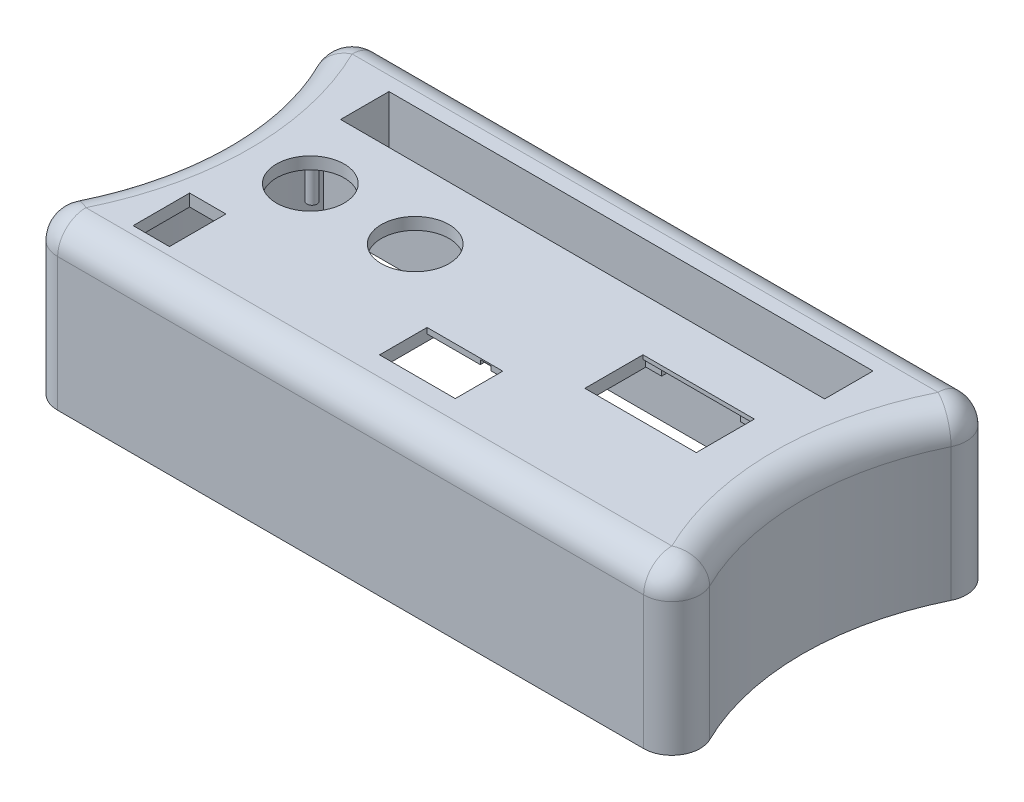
ISO-10303-21;
HEADER;
FILE_DESCRIPTION(('STEP AP214'),'2;1');
FILE_NAME('part.step','',(''),(''),'','','');
FILE_SCHEMA(('AUTOMOTIVE_DESIGN { 1 0 10303 214 1 1 1 1 }'));
ENDSEC;
DATA;
#1=APPLICATION_CONTEXT('core data for automotive mechanical design processes');
#2=APPLICATION_PROTOCOL_DEFINITION('international standard','automotive_design',2000,#1);
#3=PRODUCT_CONTEXT('',#1,'mechanical');
#4=PRODUCT('Part','Part','',(#3));
#5=PRODUCT_RELATED_PRODUCT_CATEGORY('part','',(#4));
#6=PRODUCT_DEFINITION_FORMATION('','',#4);
#7=PRODUCT_DEFINITION_CONTEXT('part definition',#1,'design');
#8=PRODUCT_DEFINITION('design','',#6,#7);
#9=PRODUCT_DEFINITION_SHAPE('','',#8);
#10=(LENGTH_UNIT() NAMED_UNIT(*) SI_UNIT(.MILLI.,.METRE.));
#11=(NAMED_UNIT(*) PLANE_ANGLE_UNIT() SI_UNIT($,.RADIAN.));
#12=(NAMED_UNIT(*) SI_UNIT($,.STERADIAN.) SOLID_ANGLE_UNIT());
#13=UNCERTAINTY_MEASURE_WITH_UNIT(LENGTH_MEASURE(1.E-05),#10,'distance_accuracy_value','');
#14=(GEOMETRIC_REPRESENTATION_CONTEXT(3) GLOBAL_UNCERTAINTY_ASSIGNED_CONTEXT((#13)) GLOBAL_UNIT_ASSIGNED_CONTEXT((#10,
#11,#12)) REPRESENTATION_CONTEXT('',''));
#15=CARTESIAN_POINT('',(0.,0.,0.));
#16=DIRECTION('',(0.,0.,1.));
#17=DIRECTION('',(1.,0.,0.));
#18=AXIS2_PLACEMENT_3D('',#15,#16,#17);
#19=CARTESIAN_POINT('',(139.919865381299,37.,0.));
#20=DIRECTION('',(0.,1.,0.));
#21=DIRECTION('',(0.,0.,1.));
#22=AXIS2_PLACEMENT_3D('',#19,#20,#21);
#23=PLANE('',#22);
#24=DIRECTION('',(-1.,0.,0.));
#25=VECTOR('',#24,1.);
#26=CARTESIAN_POINT('',(139.919865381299,37.,17.));
#27=LINE('',#26,#25);
#28=CARTESIAN_POINT('',(-53.9198653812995,37.,17.));
#29=VERTEX_POINT('',#28);
#30=CARTESIAN_POINT('',(-62.9198653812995,37.,17.));
#31=VERTEX_POINT('',#30);
#32=EDGE_CURVE('E574',#29,#31,#27,.T.);
#33=ORIENTED_EDGE('',*,*,#32,.T.);
#34=DIRECTION('',(0.,0.,1.));
#35=VECTOR('',#34,1.);
#36=CARTESIAN_POINT('',(-62.9198653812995,37.,0.));
#37=LINE('',#36,#35);
#38=CARTESIAN_POINT('',(-62.9198653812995,37.,31.));
#39=VERTEX_POINT('',#38);
#40=EDGE_CURVE('E578',#31,#39,#37,.T.);
#41=ORIENTED_EDGE('',*,*,#40,.T.);
#42=DIRECTION('',(1.,0.,0.));
#43=VECTOR('',#42,1.);
#44=CARTESIAN_POINT('',(139.919865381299,37.,31.));
#45=LINE('',#44,#43);
#46=CARTESIAN_POINT('',(-53.9198653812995,37.,31.));
#47=VERTEX_POINT('',#46);
#48=EDGE_CURVE('E558',#39,#47,#45,.T.);
#49=ORIENTED_EDGE('',*,*,#48,.T.);
#50=DIRECTION('',(0.,0.,-1.));
#51=VECTOR('',#50,1.);
#52=CARTESIAN_POINT('',(-53.9198653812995,37.,1.99086511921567E-13));
#53=LINE('',#52,#51);
#54=EDGE_CURVE('E570',#47,#29,#53,.T.);
#55=ORIENTED_EDGE('',*,*,#54,.T.);
#56=EDGE_LOOP('',(#33,#41,#49,#55));
#57=FACE_BOUND('',#56,.T.);
#58=DIRECTION('',(1.,0.,0.));
#59=VECTOR('',#58,1.);
#60=CARTESIAN_POINT('',(139.919865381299,37.,33.));
#61=LINE('',#60,#59);
#62=CARTESIAN_POINT('',(-72.6340015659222,37.,33.));
#63=VERTEX_POINT('',#62);
#64=CARTESIAN_POINT('',(72.6340015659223,37.,33.));
#65=VERTEX_POINT('',#64);
#66=EDGE_CURVE('E1049',#63,#65,#61,.T.);
#67=ORIENTED_EDGE('',*,*,#66,.F.);
#68=CARTESIAN_POINT('',(-139.919865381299,37.,0.));
#69=DIRECTION('',(0.,1.,0.));
#70=DIRECTION('',(0.,0.,1.));
#71=AXIS2_PLACEMENT_3D('',#68,#69,#70);
#72=CIRCLE('',#71,74.942561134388);
#73=CARTESIAN_POINT('',(-72.6340015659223,37.,-33.));
#74=VERTEX_POINT('',#73);
#75=EDGE_CURVE('E1057',#74,#63,#72,.F.);
#76=ORIENTED_EDGE('',*,*,#75,.F.);
#77=DIRECTION('',(1.,0.,0.));
#78=VECTOR('',#77,1.);
#79=CARTESIAN_POINT('',(139.919865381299,37.,-33.));
#80=LINE('',#79,#78);
#81=CARTESIAN_POINT('',(72.6340015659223,37.,-33.));
#82=VERTEX_POINT('',#81);
#83=EDGE_CURVE('E1058',#82,#74,#80,.F.);
#84=ORIENTED_EDGE('',*,*,#83,.F.);
#85=CARTESIAN_POINT('',(139.919865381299,37.,0.));
#86=DIRECTION('',(0.,1.,0.));
#87=DIRECTION('',(0.,0.,1.));
#88=AXIS2_PLACEMENT_3D('',#85,#86,#87);
#89=CIRCLE('',#88,74.942561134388);
#90=EDGE_CURVE('E1036',#65,#82,#89,.F.);
#91=ORIENTED_EDGE('',*,*,#90,.F.);
#92=EDGE_LOOP('',(#67,#76,#84,#91));
#93=FACE_BOUND('',#92,.T.);
#94=DIRECTION('',(0.,0.,1.));
#95=VECTOR('',#94,1.);
#96=CARTESIAN_POINT('',(28.,37.,0.));
#97=LINE('',#96,#95);
#98=CARTESIAN_POINT('',(28.,37.,-9.08919790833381));
#99=VERTEX_POINT('',#98);
#100=CARTESIAN_POINT('',(28.,37.,18.7108020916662));
#101=VERTEX_POINT('',#100);
#102=EDGE_CURVE('E1284',#99,#101,#97,.T.);
#103=ORIENTED_EDGE('',*,*,#102,.T.);
#104=DIRECTION('',(-1.,0.,0.));
#105=VECTOR('',#104,1.);
#106=CARTESIAN_POINT('',(28.,37.,18.7108020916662));
#107=LINE('',#106,#105);
#108=CARTESIAN_POINT('',(55.61,37.,18.7108020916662));
#109=VERTEX_POINT('',#108);
#110=EDGE_CURVE('E909',#109,#101,#107,.T.);
#111=ORIENTED_EDGE('',*,*,#110,.F.);
#112=DIRECTION('',(0.,0.,-1.));
#113=VECTOR('',#112,1.);
#114=CARTESIAN_POINT('',(55.61,37.,0.));
#115=LINE('',#114,#113);
#116=CARTESIAN_POINT('',(55.61,37.,-9.08919790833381));
#117=VERTEX_POINT('',#116);
#118=EDGE_CURVE('E1268',#109,#117,#115,.T.);
#119=ORIENTED_EDGE('',*,*,#118,.T.);
#120=DIRECTION('',(1.,0.,0.));
#121=VECTOR('',#120,1.);
#122=CARTESIAN_POINT('',(28.,37.,-9.08919790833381));
#123=LINE('',#122,#121);
#124=EDGE_CURVE('E872',#99,#117,#123,.T.);
#125=ORIENTED_EDGE('',*,*,#124,.F.);
#126=EDGE_LOOP('',(#103,#111,#119,#125));
#127=FACE_BOUND('',#126,.T.);
#128=CARTESIAN_POINT('',(-50.,37.,0.));
#129=DIRECTION('',(0.,1.,0.));
#130=DIRECTION('',(0.,0.,1.));
#131=AXIS2_PLACEMENT_3D('',#128,#129,#130);
#132=CIRCLE('',#131,8.4);
#133=CARTESIAN_POINT('',(-50.,37.,8.4));
#134=VERTEX_POINT('',#133);
#135=EDGE_CURVE('E508',#134,#134,#132,.T.);
#136=ORIENTED_EDGE('',*,*,#135,.T.);
#137=EDGE_LOOP('',(#136));
#138=FACE_BOUND('',#137,.T.);
#139=CARTESIAN_POINT('',(-24.,37.,0.));
#140=DIRECTION('',(0.,1.,0.));
#141=DIRECTION('',(0.,0.,1.));
#142=AXIS2_PLACEMENT_3D('',#139,#140,#141);
#143=CIRCLE('',#142,8.4);
#144=CARTESIAN_POINT('',(-24.,37.,8.4));
#145=VERTEX_POINT('',#144);
#146=EDGE_CURVE('E1112',#145,#145,#143,.T.);
#147=ORIENTED_EDGE('',*,*,#146,.T.);
#148=EDGE_LOOP('',(#147));
#149=FACE_BOUND('',#148,.T.);
#150=DIRECTION('',(-1.,0.,0.));
#151=VECTOR('',#150,1.);
#152=CARTESIAN_POINT('',(139.919865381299,37.,13.82));
#153=LINE('',#152,#151);
#154=CARTESIAN_POINT('',(14.1359984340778,37.,13.82));
#155=VERTEX_POINT('',#154);
#156=CARTESIAN_POINT('',(-4.63400156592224,37.,13.82));
#157=VERTEX_POINT('',#156);
#158=EDGE_CURVE('E1302',#155,#157,#153,.T.);
#159=ORIENTED_EDGE('',*,*,#158,.T.);
#160=DIRECTION('',(0.,0.,1.));
#161=VECTOR('',#160,1.);
#162=CARTESIAN_POINT('',(-4.63400156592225,37.,0.));
#163=LINE('',#162,#161);
#164=CARTESIAN_POINT('',(-4.63400156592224,37.,28.2));
#165=VERTEX_POINT('',#164);
#166=EDGE_CURVE('E1306',#157,#165,#163,.T.);
#167=ORIENTED_EDGE('',*,*,#166,.T.);
#168=DIRECTION('',(1.,0.,0.));
#169=VECTOR('',#168,1.);
#170=CARTESIAN_POINT('',(139.919865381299,37.,28.2));
#171=LINE('',#170,#169);
#172=CARTESIAN_POINT('',(14.1359984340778,37.,28.2));
#173=VERTEX_POINT('',#172);
#174=EDGE_CURVE('E1288',#165,#173,#171,.T.);
#175=ORIENTED_EDGE('',*,*,#174,.T.);
#176=DIRECTION('',(0.,0.,-1.));
#177=VECTOR('',#176,1.);
#178=CARTESIAN_POINT('',(14.1359984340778,37.,0.));
#179=LINE('',#178,#177);
#180=EDGE_CURVE('E1298',#173,#155,#179,.T.);
#181=ORIENTED_EDGE('',*,*,#180,.T.);
#182=EDGE_LOOP('',(#159,#167,#175,#181));
#183=FACE_BOUND('',#182,.T.);
#184=CARTESIAN_POINT('',(-15.972624,37.,8.500338));
#185=DIRECTION('',(0.,1.,0.));
#186=DIRECTION('',(0.,0.,1.));
#187=AXIS2_PLACEMENT_3D('',#184,#185,#186);
#188=CIRCLE('',#187,1.263338);
#189=CARTESIAN_POINT('',(-15.972624,37.,9.763676));
#190=VERTEX_POINT('',#189);
#191=EDGE_CURVE('E1310',#190,#190,#188,.F.);
#192=ORIENTED_EDGE('',*,*,#191,.F.);
#193=EDGE_LOOP('',(#192));
#194=FACE_BOUND('',#193,.T.);
#195=CARTESIAN_POINT('',(-16.01597,37.,-8.495881));
#196=DIRECTION('',(0.,1.,0.));
#197=DIRECTION('',(0.,0.,1.));
#198=AXIS2_PLACEMENT_3D('',#195,#196,#197);
#199=CIRCLE('',#198,1.263338);
#200=CARTESIAN_POINT('',(-16.01597,37.,-7.232543));
#201=VERTEX_POINT('',#200);
#202=EDGE_CURVE('E1314',#201,#201,#199,.F.);
#203=ORIENTED_EDGE('',*,*,#202,.F.);
#204=EDGE_LOOP('',(#203));
#205=FACE_BOUND('',#204,.T.);
#206=CARTESIAN_POINT('',(-58.009512,37.,-8.435665));
#207=DIRECTION('',(0.,1.,0.));
#208=DIRECTION('',(0.,0.,1.));
#209=AXIS2_PLACEMENT_3D('',#206,#207,#208);
#210=CIRCLE('',#209,1.26333800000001);
#211=CARTESIAN_POINT('',(-58.009512,37.,-7.17232699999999));
#212=VERTEX_POINT('',#211);
#213=EDGE_CURVE('E1318',#212,#212,#210,.F.);
#214=ORIENTED_EDGE('',*,*,#213,.F.);
#215=EDGE_LOOP('',(#214));
#216=FACE_BOUND('',#215,.T.);
#217=CARTESIAN_POINT('',(-57.980045,37.,8.57921));
#218=DIRECTION('',(0.,1.,0.));
#219=DIRECTION('',(0.,0.,1.));
#220=AXIS2_PLACEMENT_3D('',#217,#218,#219);
#221=CIRCLE('',#220,1.263338);
#222=CARTESIAN_POINT('',(-57.980045,37.,9.842548));
#223=VERTEX_POINT('',#222);
#224=EDGE_CURVE('E1322',#223,#223,#221,.F.);
#225=ORIENTED_EDGE('',*,*,#224,.F.);
#226=EDGE_LOOP('',(#225));
#227=FACE_BOUND('',#226,.T.);
#228=DIRECTION('',(0.,0.,-1.));
#229=VECTOR('',#228,1.);
#230=CARTESIAN_POINT('',(-62.3818346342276,37.,-15.6));
#231=LINE('',#230,#229);
#232=CARTESIAN_POINT('',(-62.3818346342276,37.,-15.6));
#233=VERTEX_POINT('',#232);
#234=CARTESIAN_POINT('',(-62.3818346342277,37.,-31.6));
#235=VERTEX_POINT('',#234);
#236=EDGE_CURVE('E644',#233,#235,#231,.T.);
#237=ORIENTED_EDGE('',*,*,#236,.F.);
#238=DIRECTION('',(-1.,0.,0.));
#239=VECTOR('',#238,1.);
#240=CARTESIAN_POINT('',(-62.3818346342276,37.,-15.6));
#241=LINE('',#240,#239);
#242=CARTESIAN_POINT('',(62.038133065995,37.,-15.6));
#243=VERTEX_POINT('',#242);
#244=EDGE_CURVE('E659',#243,#233,#241,.T.);
#245=ORIENTED_EDGE('',*,*,#244,.F.);
#246=DIRECTION('',(0.,0.,1.));
#247=VECTOR('',#246,1.);
#248=CARTESIAN_POINT('',(62.038133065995,37.,-15.6));
#249=LINE('',#248,#247);
#250=CARTESIAN_POINT('',(62.038133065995,37.,-31.6));
#251=VERTEX_POINT('',#250);
#252=EDGE_CURVE('E676',#251,#243,#249,.T.);
#253=ORIENTED_EDGE('',*,*,#252,.F.);
#254=DIRECTION('',(1.,0.,0.));
#255=VECTOR('',#254,1.);
#256=CARTESIAN_POINT('',(-62.3818346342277,37.,-31.6));
#257=LINE('',#256,#255);
#258=EDGE_CURVE('E672',#235,#251,#257,.T.);
#259=ORIENTED_EDGE('',*,*,#258,.F.);
#260=EDGE_LOOP('',(#237,#245,#253,#259));
#261=FACE_BOUND('',#260,.T.);
#262=ADVANCED_FACE('F46',(#57,#93,#127,#138,#149,#183,#194,#205,#216,#227,#261),#23,.F.);
#263=CARTESIAN_POINT('',(-4.49900156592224,38.6,28.16));
#264=DIRECTION('',(0.,-1.,0.));
#265=DIRECTION('',(0.,0.,-1.));
#266=AXIS2_PLACEMENT_3D('',#263,#264,#265);
#267=PLANE('',#266);
#268=DIRECTION('',(0.,0.,1.));
#269=VECTOR('',#268,1.);
#270=CARTESIAN_POINT('',(8.56599843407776,38.6,10.9045240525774));
#271=LINE('',#270,#269);
#272=CARTESIAN_POINT('',(8.56599843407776,38.6,13.82));
#273=VERTEX_POINT('',#272);
#274=CARTESIAN_POINT('',(8.56599843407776,38.6,16.42));
#275=VERTEX_POINT('',#274);
#276=EDGE_CURVE('E724',#273,#275,#271,.T.);
#277=ORIENTED_EDGE('',*,*,#276,.T.);
#278=DIRECTION('',(1.,0.,0.));
#279=VECTOR('',#278,1.);
#280=CARTESIAN_POINT('',(-4.63400156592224,38.6,16.42));
#281=LINE('',#280,#279);
#282=CARTESIAN_POINT('',(-4.63400156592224,38.6,16.42));
#283=VERTEX_POINT('',#282);
#284=EDGE_CURVE('E739',#283,#275,#281,.T.);
#285=ORIENTED_EDGE('',*,*,#284,.F.);
#286=DIRECTION('',(0.,0.,1.));
#287=VECTOR('',#286,1.);
#288=CARTESIAN_POINT('',(-4.63400156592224,38.6,13.82));
#289=LINE('',#288,#287);
#290=CARTESIAN_POINT('',(-4.63400156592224,38.6,13.82));
#291=VERTEX_POINT('',#290);
#292=EDGE_CURVE('E744',#291,#283,#289,.T.);
#293=ORIENTED_EDGE('',*,*,#292,.F.);
#294=DIRECTION('',(-1.,0.,0.));
#295=VECTOR('',#294,1.);
#296=CARTESIAN_POINT('',(-4.63400156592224,38.6,13.82));
#297=LINE('',#296,#295);
#298=EDGE_CURVE('E753',#273,#291,#297,.T.);
#299=ORIENTED_EDGE('',*,*,#298,.F.);
#300=EDGE_LOOP('',(#277,#285,#293,#299));
#301=FACE_BOUND('',#300,.T.);
#302=ADVANCED_FACE('F1402',(#301),#267,.T.);
#303=CARTESIAN_POINT('',(55.61,0.,-4.46919790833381));
#304=DIRECTION('',(1.,0.,0.));
#305=DIRECTION('',(0.,0.,-1.));
#306=AXIS2_PLACEMENT_3D('',#303,#304,#305);
#307=PLANE('',#306);
#308=DIRECTION('',(0.,1.,0.));
#309=VECTOR('',#308,1.);
#310=CARTESIAN_POINT('',(55.61,31.4431457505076,-5.08919790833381));
#311=LINE('',#310,#309);
#312=CARTESIAN_POINT('',(55.61,37.1,-5.08919790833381));
#313=VERTEX_POINT('',#312);
#314=CARTESIAN_POINT('',(55.61,39.,-5.08919790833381));
#315=VERTEX_POINT('',#314);
#316=EDGE_CURVE('E774',#313,#315,#311,.T.);
#317=ORIENTED_EDGE('',*,*,#316,.F.);
#318=DIRECTION('',(0.,0.,1.));
#319=VECTOR('',#318,1.);
#320=CARTESIAN_POINT('',(55.61,37.1,-9.08919790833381));
#321=LINE('',#320,#319);
#322=CARTESIAN_POINT('',(55.61,37.1,-9.08919790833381));
#323=VERTEX_POINT('',#322);
#324=EDGE_CURVE('E780',#323,#313,#321,.T.);
#325=ORIENTED_EDGE('',*,*,#324,.F.);
#326=DIRECTION('',(0.,-1.,0.));
#327=VECTOR('',#326,1.);
#328=CARTESIAN_POINT('',(55.61,39.,-9.08919790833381));
#329=LINE('',#328,#327);
#330=EDGE_CURVE('E920',#323,#117,#329,.T.);
#331=ORIENTED_EDGE('',*,*,#330,.T.);
#332=ORIENTED_EDGE('',*,*,#118,.F.);
#333=DIRECTION('',(0.,-1.,0.));
#334=VECTOR('',#333,1.);
#335=CARTESIAN_POINT('',(55.61,39.,18.7108020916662));
#336=LINE('',#335,#334);
#337=CARTESIAN_POINT('',(55.61,37.1,18.7108020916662));
#338=VERTEX_POINT('',#337);
#339=EDGE_CURVE('E917',#338,#109,#336,.T.);
#340=ORIENTED_EDGE('',*,*,#339,.F.);
#341=DIRECTION('',(0.,0.,1.));
#342=VECTOR('',#341,1.);
#343=CARTESIAN_POINT('',(55.61,37.1,18.7108020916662));
#344=LINE('',#343,#342);
#345=CARTESIAN_POINT('',(55.61,37.1,14.7108020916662));
#346=VERTEX_POINT('',#345);
#347=EDGE_CURVE('E811',#346,#338,#344,.T.);
#348=ORIENTED_EDGE('',*,*,#347,.F.);
#349=DIRECTION('',(0.,1.,0.));
#350=VECTOR('',#349,1.);
#351=CARTESIAN_POINT('',(55.61,31.4431457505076,14.7108020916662));
#352=LINE('',#351,#350);
#353=CARTESIAN_POINT('',(55.61,39.,14.7108020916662));
#354=VERTEX_POINT('',#353);
#355=EDGE_CURVE('E795',#346,#354,#352,.T.);
#356=ORIENTED_EDGE('',*,*,#355,.T.);
#357=DIRECTION('',(0.,0.,1.));
#358=VECTOR('',#357,1.);
#359=CARTESIAN_POINT('',(55.61,39.,18.7108020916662));
#360=LINE('',#359,#358);
#361=CARTESIAN_POINT('',(55.61,39.,9.93080209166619));
#362=VERTEX_POINT('',#361);
#363=EDGE_CURVE('E898',#362,#354,#360,.T.);
#364=ORIENTED_EDGE('',*,*,#363,.F.);
#365=DIRECTION('',(0.,1.,0.));
#366=VECTOR('',#365,1.);
#367=CARTESIAN_POINT('',(55.61,0.,9.93080209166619));
#368=LINE('',#367,#366);
#369=CARTESIAN_POINT('',(55.61,40.,9.93080209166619));
#370=VERTEX_POINT('',#369);
#371=EDGE_CURVE('E1000',#362,#370,#368,.T.);
#372=ORIENTED_EDGE('',*,*,#371,.T.);
#373=DIRECTION('',(0.,0.,-1.));
#374=VECTOR('',#373,1.);
#375=CARTESIAN_POINT('',(55.61,40.,-4.46919790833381));
#376=LINE('',#375,#374);
#377=CARTESIAN_POINT('',(55.61,40.,-4.46919790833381));
#378=VERTEX_POINT('',#377);
#379=EDGE_CURVE('E1012',#370,#378,#376,.T.);
#380=ORIENTED_EDGE('',*,*,#379,.T.);
#381=DIRECTION('',(0.,1.,0.));
#382=VECTOR('',#381,1.);
#383=CARTESIAN_POINT('',(55.61,0.,-4.46919790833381));
#384=LINE('',#383,#382);
#385=CARTESIAN_POINT('',(55.61,39.,-4.46919790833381));
#386=VERTEX_POINT('',#385);
#387=EDGE_CURVE('E1003',#386,#378,#384,.T.);
#388=ORIENTED_EDGE('',*,*,#387,.F.);
#389=EDGE_CURVE('E899',#315,#386,#360,.T.);
#390=ORIENTED_EDGE('',*,*,#389,.F.);
#391=EDGE_LOOP('',(#317,#325,#331,#332,#340,#348,#356,#364,#372,#380,#388,#390));
#392=FACE_BOUND('',#391,.T.);
#393=ADVANCED_FACE('F1408',(#392),#307,.F.);
#394=CARTESIAN_POINT('',(0.,39.,0.));
#395=DIRECTION('',(0.,1.,0.));
#396=DIRECTION('',(0.,0.,1.));
#397=AXIS2_PLACEMENT_3D('',#394,#395,#396);
#398=PLANE('',#397);
#399=DIRECTION('',(-1.,0.,0.));
#400=VECTOR('',#399,1.);
#401=CARTESIAN_POINT('',(55.61,39.,-5.08919790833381));
#402=LINE('',#401,#400);
#403=CARTESIAN_POINT('',(51.61,39.,-5.08919790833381));
#404=VERTEX_POINT('',#403);
#405=EDGE_CURVE('E773',#315,#404,#402,.T.);
#406=ORIENTED_EDGE('',*,*,#405,.F.);
#407=ORIENTED_EDGE('',*,*,#389,.T.);
#408=DIRECTION('',(1.,0.,0.));
#409=VECTOR('',#408,1.);
#410=CARTESIAN_POINT('',(28.,39.,-4.46919790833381));
#411=LINE('',#410,#409);
#412=CARTESIAN_POINT('',(28.,39.,-4.46919790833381));
#413=VERTEX_POINT('',#412);
#414=EDGE_CURVE('E916',#413,#386,#411,.T.);
#415=ORIENTED_EDGE('',*,*,#414,.F.);
#416=DIRECTION('',(0.,0.,-1.));
#417=VECTOR('',#416,1.);
#418=CARTESIAN_POINT('',(28.,39.,-9.08919790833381));
#419=LINE('',#418,#417);
#420=CARTESIAN_POINT('',(28.,39.,-5.08919790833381));
#421=VERTEX_POINT('',#420);
#422=EDGE_CURVE('E894',#413,#421,#419,.T.);
#423=ORIENTED_EDGE('',*,*,#422,.T.);
#424=DIRECTION('',(-1.,0.,0.));
#425=VECTOR('',#424,1.);
#426=CARTESIAN_POINT('',(28.,39.,-5.08919790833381));
#427=LINE('',#426,#425);
#428=CARTESIAN_POINT('',(32.,39.,-5.08919790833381));
#429=VERTEX_POINT('',#428);
#430=EDGE_CURVE('E858',#429,#421,#427,.T.);
#431=ORIENTED_EDGE('',*,*,#430,.F.);
#432=DIRECTION('',(0.,0.,1.));
#433=VECTOR('',#432,1.);
#434=CARTESIAN_POINT('',(32.,39.,-9.08919790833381));
#435=LINE('',#434,#433);
#436=CARTESIAN_POINT('',(32.,39.,-9.08919790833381));
#437=VERTEX_POINT('',#436);
#438=EDGE_CURVE('E863',#437,#429,#435,.T.);
#439=ORIENTED_EDGE('',*,*,#438,.F.);
#440=DIRECTION('',(1.,0.,0.));
#441=VECTOR('',#440,1.);
#442=CARTESIAN_POINT('',(28.,39.,-9.08919790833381));
#443=LINE('',#442,#441);
#444=CARTESIAN_POINT('',(51.61,39.,-9.08919790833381));
#445=VERTEX_POINT('',#444);
#446=EDGE_CURVE('E893',#437,#445,#443,.T.);
#447=ORIENTED_EDGE('',*,*,#446,.T.);
#448=DIRECTION('',(0.,0.,-1.));
#449=VECTOR('',#448,1.);
#450=CARTESIAN_POINT('',(51.61,39.,-9.08919790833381));
#451=LINE('',#450,#449);
#452=EDGE_CURVE('E768',#404,#445,#451,.T.);
#453=ORIENTED_EDGE('',*,*,#452,.F.);
#454=EDGE_LOOP('',(#406,#407,#415,#423,#431,#439,#447,#453));
#455=FACE_BOUND('',#454,.T.);
#456=ADVANCED_FACE('F1638',(#455),#398,.F.);
#457=CARTESIAN_POINT('',(28.,39.,-9.08919790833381));
#458=DIRECTION('',(0.,0.,-1.));
#459=DIRECTION('',(-1.,0.,0.));
#460=AXIS2_PLACEMENT_3D('',#457,#458,#459);
#461=PLANE('',#460);
#462=DIRECTION('',(0.,1.,0.));
#463=VECTOR('',#462,1.);
#464=CARTESIAN_POINT('',(51.61,31.4431457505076,-9.08919790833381));
#465=LINE('',#464,#463);
#466=CARTESIAN_POINT('',(51.61,37.1,-9.08919790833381));
#467=VERTEX_POINT('',#466);
#468=EDGE_CURVE('E764',#467,#445,#465,.T.);
#469=ORIENTED_EDGE('',*,*,#468,.T.);
#470=ORIENTED_EDGE('',*,*,#446,.F.);
#471=DIRECTION('',(0.,1.,0.));
#472=VECTOR('',#471,1.);
#473=CARTESIAN_POINT('',(32.,31.4431457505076,-9.08919790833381));
#474=LINE('',#473,#472);
#475=CARTESIAN_POINT('',(32.,37.1,-9.08919790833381));
#476=VERTEX_POINT('',#475);
#477=EDGE_CURVE('E867',#476,#437,#474,.T.);
#478=ORIENTED_EDGE('',*,*,#477,.F.);
#479=DIRECTION('',(1.,0.,0.));
#480=VECTOR('',#479,1.);
#481=CARTESIAN_POINT('',(28.,37.1,-9.08919790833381));
#482=LINE('',#481,#480);
#483=CARTESIAN_POINT('',(28.,37.1,-9.08919790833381));
#484=VERTEX_POINT('',#483);
#485=EDGE_CURVE('E873',#484,#476,#482,.T.);
#486=ORIENTED_EDGE('',*,*,#485,.F.);
#487=DIRECTION('',(0.,-1.,0.));
#488=VECTOR('',#487,1.);
#489=CARTESIAN_POINT('',(28.,39.,-9.08919790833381));
#490=LINE('',#489,#488);
#491=EDGE_CURVE('E905',#484,#99,#490,.T.);
#492=ORIENTED_EDGE('',*,*,#491,.T.);
#493=ORIENTED_EDGE('',*,*,#124,.T.);
#494=ORIENTED_EDGE('',*,*,#330,.F.);
#495=DIRECTION('',(1.,0.,0.));
#496=VECTOR('',#495,1.);
#497=CARTESIAN_POINT('',(55.61,37.1,-9.08919790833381));
#498=LINE('',#497,#496);
#499=EDGE_CURVE('E769',#467,#323,#498,.T.);
#500=ORIENTED_EDGE('',*,*,#499,.F.);
#501=EDGE_LOOP('',(#469,#470,#478,#486,#492,#493,#494,#500));
#502=FACE_BOUND('',#501,.T.);
#503=ADVANCED_FACE('F1709',(#502),#461,.F.);
#504=DIRECTION('',(0.,0.,-1.));
#505=VECTOR('',#504,1.);
#506=CARTESIAN_POINT('',(51.61,39.,18.7108020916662));
#507=LINE('',#506,#505);
#508=CARTESIAN_POINT('',(51.61,39.,18.7108020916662));
#509=VERTEX_POINT('',#508);
#510=CARTESIAN_POINT('',(51.61,39.,14.7108020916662));
#511=VERTEX_POINT('',#510);
#512=EDGE_CURVE('E804',#509,#511,#507,.T.);
#513=ORIENTED_EDGE('',*,*,#512,.F.);
#514=DIRECTION('',(-1.,0.,0.));
#515=VECTOR('',#514,1.);
#516=CARTESIAN_POINT('',(28.,39.,18.7108020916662));
#517=LINE('',#516,#515);
#518=CARTESIAN_POINT('',(32.,39.,18.7108020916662));
#519=VERTEX_POINT('',#518);
#520=EDGE_CURVE('E902',#509,#519,#517,.T.);
#521=ORIENTED_EDGE('',*,*,#520,.T.);
#522=DIRECTION('',(0.,0.,1.));
#523=VECTOR('',#522,1.);
#524=CARTESIAN_POINT('',(32.,39.,18.7108020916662));
#525=LINE('',#524,#523);
#526=CARTESIAN_POINT('',(32.,39.,14.7108020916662));
#527=VERTEX_POINT('',#526);
#528=EDGE_CURVE('E830',#527,#519,#525,.T.);
#529=ORIENTED_EDGE('',*,*,#528,.F.);
#530=DIRECTION('',(1.,0.,0.));
#531=VECTOR('',#530,1.);
#532=CARTESIAN_POINT('',(28.,39.,14.7108020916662));
#533=LINE('',#532,#531);
#534=CARTESIAN_POINT('',(28.,39.,14.7108020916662));
#535=VERTEX_POINT('',#534);
#536=EDGE_CURVE('E835',#535,#527,#533,.T.);
#537=ORIENTED_EDGE('',*,*,#536,.F.);
#538=CARTESIAN_POINT('',(28.,39.,9.93080209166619));
#539=VERTEX_POINT('',#538);
#540=EDGE_CURVE('E890',#535,#539,#419,.T.);
#541=ORIENTED_EDGE('',*,*,#540,.T.);
#542=DIRECTION('',(-1.,0.,0.));
#543=VECTOR('',#542,1.);
#544=CARTESIAN_POINT('',(28.,39.,9.93080209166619));
#545=LINE('',#544,#543);
#546=EDGE_CURVE('E1326',#362,#539,#545,.T.);
#547=ORIENTED_EDGE('',*,*,#546,.F.);
#548=ORIENTED_EDGE('',*,*,#363,.T.);
#549=DIRECTION('',(1.,0.,0.));
#550=VECTOR('',#549,1.);
#551=CARTESIAN_POINT('',(55.61,39.,14.7108020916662));
#552=LINE('',#551,#550);
#553=EDGE_CURVE('E805',#511,#354,#552,.T.);
#554=ORIENTED_EDGE('',*,*,#553,.F.);
#555=EDGE_LOOP('',(#513,#521,#529,#537,#541,#547,#548,#554));
#556=FACE_BOUND('',#555,.T.);
#557=ADVANCED_FACE('F1712',(#556),#398,.F.);
#558=CARTESIAN_POINT('',(28.,39.,18.7108020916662));
#559=DIRECTION('',(0.,0.,1.));
#560=DIRECTION('',(1.,0.,0.));
#561=AXIS2_PLACEMENT_3D('',#558,#559,#560);
#562=PLANE('',#561);
#563=DIRECTION('',(0.,1.,0.));
#564=VECTOR('',#563,1.);
#565=CARTESIAN_POINT('',(51.61,31.4431457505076,18.7108020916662));
#566=LINE('',#565,#564);
#567=CARTESIAN_POINT('',(51.61,37.1,18.7108020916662));
#568=VERTEX_POINT('',#567);
#569=EDGE_CURVE('E800',#568,#509,#566,.T.);
#570=ORIENTED_EDGE('',*,*,#569,.F.);
#571=DIRECTION('',(-1.,0.,0.));
#572=VECTOR('',#571,1.);
#573=CARTESIAN_POINT('',(55.61,37.1,18.7108020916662));
#574=LINE('',#573,#572);
#575=EDGE_CURVE('E814',#338,#568,#574,.T.);
#576=ORIENTED_EDGE('',*,*,#575,.F.);
#577=ORIENTED_EDGE('',*,*,#339,.T.);
#578=ORIENTED_EDGE('',*,*,#110,.T.);
#579=DIRECTION('',(0.,-1.,0.));
#580=VECTOR('',#579,1.);
#581=CARTESIAN_POINT('',(28.,39.,18.7108020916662));
#582=LINE('',#581,#580);
#583=CARTESIAN_POINT('',(28.,37.1,18.7108020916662));
#584=VERTEX_POINT('',#583);
#585=EDGE_CURVE('E913',#584,#101,#582,.T.);
#586=ORIENTED_EDGE('',*,*,#585,.F.);
#587=DIRECTION('',(-1.,0.,0.));
#588=VECTOR('',#587,1.);
#589=CARTESIAN_POINT('',(28.,37.1,18.7108020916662));
#590=LINE('',#589,#588);
#591=CARTESIAN_POINT('',(32.,37.1,18.7108020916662));
#592=VERTEX_POINT('',#591);
#593=EDGE_CURVE('E831',#592,#584,#590,.T.);
#594=ORIENTED_EDGE('',*,*,#593,.F.);
#595=DIRECTION('',(0.,1.,0.));
#596=VECTOR('',#595,1.);
#597=CARTESIAN_POINT('',(32.,31.4431457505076,18.7108020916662));
#598=LINE('',#597,#596);
#599=EDGE_CURVE('E826',#592,#519,#598,.T.);
#600=ORIENTED_EDGE('',*,*,#599,.T.);
#601=ORIENTED_EDGE('',*,*,#520,.F.);
#602=EDGE_LOOP('',(#570,#576,#577,#578,#586,#594,#600,#601));
#603=FACE_BOUND('',#602,.T.);
#604=ADVANCED_FACE('F1645',(#603),#562,.F.);
#605=CARTESIAN_POINT('',(28.,0.,-4.46919790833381));
#606=DIRECTION('',(-1.,0.,0.));
#607=DIRECTION('',(0.,0.,1.));
#608=AXIS2_PLACEMENT_3D('',#605,#606,#607);
#609=PLANE('',#608);
#610=DIRECTION('',(0.,1.,0.));
#611=VECTOR('',#610,1.);
#612=CARTESIAN_POINT('',(28.,31.4431457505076,14.7108020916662));
#613=LINE('',#612,#611);
#614=CARTESIAN_POINT('',(28.,37.1,14.7108020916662));
#615=VERTEX_POINT('',#614);
#616=EDGE_CURVE('E836',#615,#535,#613,.T.);
#617=ORIENTED_EDGE('',*,*,#616,.F.);
#618=DIRECTION('',(0.,0.,-1.));
#619=VECTOR('',#618,1.);
#620=CARTESIAN_POINT('',(28.,37.1,18.7108020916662));
#621=LINE('',#620,#619);
#622=EDGE_CURVE('E842',#584,#615,#621,.T.);
#623=ORIENTED_EDGE('',*,*,#622,.F.);
#624=ORIENTED_EDGE('',*,*,#585,.T.);
#625=ORIENTED_EDGE('',*,*,#102,.F.);
#626=ORIENTED_EDGE('',*,*,#491,.F.);
#627=DIRECTION('',(0.,0.,-1.));
#628=VECTOR('',#627,1.);
#629=CARTESIAN_POINT('',(28.,37.1,-9.08919790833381));
#630=LINE('',#629,#628);
#631=CARTESIAN_POINT('',(28.,37.1,-5.08919790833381));
#632=VERTEX_POINT('',#631);
#633=EDGE_CURVE('E877',#632,#484,#630,.T.);
#634=ORIENTED_EDGE('',*,*,#633,.F.);
#635=DIRECTION('',(0.,1.,0.));
#636=VECTOR('',#635,1.);
#637=CARTESIAN_POINT('',(28.,31.4431457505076,-5.08919790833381));
#638=LINE('',#637,#636);
#639=EDGE_CURVE('E839',#632,#421,#638,.T.);
#640=ORIENTED_EDGE('',*,*,#639,.T.);
#641=ORIENTED_EDGE('',*,*,#422,.F.);
#642=DIRECTION('',(0.,1.,0.));
#643=VECTOR('',#642,1.);
#644=CARTESIAN_POINT('',(28.,0.,-4.46919790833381));
#645=LINE('',#644,#643);
#646=CARTESIAN_POINT('',(28.,40.,-4.46919790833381));
#647=VERTEX_POINT('',#646);
#648=EDGE_CURVE('E1006',#413,#647,#645,.T.);
#649=ORIENTED_EDGE('',*,*,#648,.T.);
#650=DIRECTION('',(0.,0.,1.));
#651=VECTOR('',#650,1.);
#652=CARTESIAN_POINT('',(28.,40.,-4.46919790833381));
#653=LINE('',#652,#651);
#654=CARTESIAN_POINT('',(28.,40.,9.93080209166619));
#655=VERTEX_POINT('',#654);
#656=EDGE_CURVE('E949',#647,#655,#653,.T.);
#657=ORIENTED_EDGE('',*,*,#656,.T.);
#658=DIRECTION('',(0.,1.,0.));
#659=VECTOR('',#658,1.);
#660=CARTESIAN_POINT('',(28.,0.,9.93080209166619));
#661=LINE('',#660,#659);
#662=EDGE_CURVE('E996',#539,#655,#661,.T.);
#663=ORIENTED_EDGE('',*,*,#662,.F.);
#664=ORIENTED_EDGE('',*,*,#540,.F.);
#665=EDGE_LOOP('',(#617,#623,#624,#625,#626,#634,#640,#641,#649,#657,#663,#664));
#666=FACE_BOUND('',#665,.T.);
#667=ADVANCED_FACE('F1476',(#666),#609,.F.);
#668=CARTESIAN_POINT('',(139.919865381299,0.,0.));
#669=DIRECTION('',(0.,1.,0.));
#670=DIRECTION('',(0.,0.,1.));
#671=AXIS2_PLACEMENT_3D('',#668,#669,#670);
#672=PLANE('',#671);
#673=DIRECTION('',(-1.,0.,0.));
#674=VECTOR('',#673,1.);
#675=CARTESIAN_POINT('',(-85.,0.,-40.));
#676=LINE('',#675,#674);
#677=CARTESIAN_POINT('',(72.6340015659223,0.,-40.));
#678=VERTEX_POINT('',#677);
#679=CARTESIAN_POINT('',(-72.6340015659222,0.,-40.));
#680=VERTEX_POINT('',#679);
#681=EDGE_CURVE('E1159',#678,#680,#676,.T.);
#682=ORIENTED_EDGE('',*,*,#681,.F.);
#683=CARTESIAN_POINT('',(72.6340015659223,0.,-33.));
#684=DIRECTION('',(0.,1.,0.));
#685=DIRECTION('',(0.,0.,1.));
#686=AXIS2_PLACEMENT_3D('',#683,#684,#685);
#687=CIRCLE('',#686,7.);
#688=CARTESIAN_POINT('',(78.9188287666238,0.,-29.9176393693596));
#689=VERTEX_POINT('',#688);
#690=EDGE_CURVE('E1247',#678,#689,#687,.F.);
#691=ORIENTED_EDGE('',*,*,#690,.T.);
#692=CARTESIAN_POINT('',(139.919865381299,0.,0.));
#693=DIRECTION('',(0.,-1.,0.));
#694=DIRECTION('',(0.,0.,1.));
#695=AXIS2_PLACEMENT_3D('',#692,#693,#694);
#696=CIRCLE('',#695,67.942561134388);
#697=CARTESIAN_POINT('',(78.9188287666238,0.,29.9176393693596));
#698=VERTEX_POINT('',#697);
#699=EDGE_CURVE('E1155',#698,#689,#696,.T.);
#700=ORIENTED_EDGE('',*,*,#699,.F.);
#701=CARTESIAN_POINT('',(72.6340015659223,0.,33.));
#702=DIRECTION('',(0.,1.,0.));
#703=DIRECTION('',(0.,0.,1.));
#704=AXIS2_PLACEMENT_3D('',#701,#702,#703);
#705=CIRCLE('',#704,7.);
#706=CARTESIAN_POINT('',(72.6340015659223,0.,40.));
#707=VERTEX_POINT('',#706);
#708=EDGE_CURVE('E1244',#698,#707,#705,.F.);
#709=ORIENTED_EDGE('',*,*,#708,.T.);
#710=DIRECTION('',(1.,0.,0.));
#711=VECTOR('',#710,1.);
#712=CARTESIAN_POINT('',(-85.,0.,40.));
#713=LINE('',#712,#711);
#714=CARTESIAN_POINT('',(-72.6340015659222,0.,40.));
#715=VERTEX_POINT('',#714);
#716=EDGE_CURVE('E1168',#715,#707,#713,.T.);
#717=ORIENTED_EDGE('',*,*,#716,.F.);
#718=CARTESIAN_POINT('',(-72.6340015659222,0.,33.));
#719=DIRECTION('',(0.,1.,0.));
#720=DIRECTION('',(0.,0.,1.));
#721=AXIS2_PLACEMENT_3D('',#718,#719,#720);
#722=CIRCLE('',#721,7.);
#723=CARTESIAN_POINT('',(-78.9188287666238,0.,29.9176393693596));
#724=VERTEX_POINT('',#723);
#725=EDGE_CURVE('E1241',#715,#724,#722,.F.);
#726=ORIENTED_EDGE('',*,*,#725,.T.);
#727=CARTESIAN_POINT('',(-139.919865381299,0.,0.));
#728=DIRECTION('',(0.,-1.,0.));
#729=DIRECTION('',(0.,0.,-1.));
#730=AXIS2_PLACEMENT_3D('',#727,#728,#729);
#731=CIRCLE('',#730,67.942561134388);
#732=CARTESIAN_POINT('',(-78.9188287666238,0.,-29.9176393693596));
#733=VERTEX_POINT('',#732);
#734=EDGE_CURVE('E1164',#733,#724,#731,.T.);
#735=ORIENTED_EDGE('',*,*,#734,.F.);
#736=CARTESIAN_POINT('',(-72.6340015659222,0.,-33.));
#737=DIRECTION('',(0.,1.,0.));
#738=DIRECTION('',(0.,0.,1.));
#739=AXIS2_PLACEMENT_3D('',#736,#737,#738);
#740=CIRCLE('',#739,7.);
#741=EDGE_CURVE('E1238',#733,#680,#740,.F.);
#742=ORIENTED_EDGE('',*,*,#741,.T.);
#743=EDGE_LOOP('',(#682,#691,#700,#709,#717,#726,#735,#742));
#744=FACE_BOUND('',#743,.T.);
#745=CARTESIAN_POINT('',(72.6340015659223,0.,-33.));
#746=DIRECTION('',(0.,1.,0.));
#747=DIRECTION('',(0.,0.,1.));
#748=AXIS2_PLACEMENT_3D('',#745,#746,#747);
#749=CIRCLE('',#748,4.);
#750=CARTESIAN_POINT('',(72.6340015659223,0.,-37.));
#751=VERTEX_POINT('',#750);
#752=CARTESIAN_POINT('',(76.2253313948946,0.,-31.2386510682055));
#753=VERTEX_POINT('',#752);
#754=EDGE_CURVE('E1039',#751,#753,#749,.F.);
#755=ORIENTED_EDGE('',*,*,#754,.F.);
#756=DIRECTION('',(-1.,0.,0.));
#757=VECTOR('',#756,1.);
#758=CARTESIAN_POINT('',(-85.,0.,-37.));
#759=LINE('',#758,#757);
#760=CARTESIAN_POINT('',(-72.6340015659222,0.,-37.));
#761=VERTEX_POINT('',#760);
#762=EDGE_CURVE('E1134',#751,#761,#759,.T.);
#763=ORIENTED_EDGE('',*,*,#762,.T.);
#764=CARTESIAN_POINT('',(-72.6340015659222,0.,-33.));
#765=DIRECTION('',(0.,1.,0.));
#766=DIRECTION('',(0.,0.,1.));
#767=AXIS2_PLACEMENT_3D('',#764,#765,#766);
#768=CIRCLE('',#767,4.);
#769=CARTESIAN_POINT('',(-76.2253313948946,0.,-31.2386510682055));
#770=VERTEX_POINT('',#769);
#771=EDGE_CURVE('E1121',#770,#761,#768,.F.);
#772=ORIENTED_EDGE('',*,*,#771,.F.);
#773=CARTESIAN_POINT('',(-139.919865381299,0.,0.));
#774=DIRECTION('',(0.,1.,0.));
#775=DIRECTION('',(0.,0.,1.));
#776=AXIS2_PLACEMENT_3D('',#773,#774,#775);
#777=CIRCLE('',#776,70.942561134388);
#778=CARTESIAN_POINT('',(-76.2253313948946,0.,31.2386510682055));
#779=VERTEX_POINT('',#778);
#780=EDGE_CURVE('E1142',#770,#779,#777,.F.);
#781=ORIENTED_EDGE('',*,*,#780,.T.);
#782=CARTESIAN_POINT('',(-72.6340015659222,0.,33.));
#783=DIRECTION('',(0.,1.,0.));
#784=DIRECTION('',(0.,0.,1.));
#785=AXIS2_PLACEMENT_3D('',#782,#783,#784);
#786=CIRCLE('',#785,4.);
#787=CARTESIAN_POINT('',(-72.6340015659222,0.,37.));
#788=VERTEX_POINT('',#787);
#789=EDGE_CURVE('E1138',#788,#779,#786,.F.);
#790=ORIENTED_EDGE('',*,*,#789,.F.);
#791=DIRECTION('',(1.,0.,0.));
#792=VECTOR('',#791,1.);
#793=CARTESIAN_POINT('',(-85.,0.,37.));
#794=LINE('',#793,#792);
#795=CARTESIAN_POINT('',(72.6340015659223,0.,37.));
#796=VERTEX_POINT('',#795);
#797=EDGE_CURVE('E1062',#788,#796,#794,.T.);
#798=ORIENTED_EDGE('',*,*,#797,.T.);
#799=CARTESIAN_POINT('',(72.6340015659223,0.,33.));
#800=DIRECTION('',(0.,1.,0.));
#801=DIRECTION('',(0.,0.,1.));
#802=AXIS2_PLACEMENT_3D('',#799,#800,#801);
#803=CIRCLE('',#802,4.);
#804=CARTESIAN_POINT('',(76.2253313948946,0.,31.2386510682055));
#805=VERTEX_POINT('',#804);
#806=EDGE_CURVE('E1135',#805,#796,#803,.F.);
#807=ORIENTED_EDGE('',*,*,#806,.F.);
#808=CARTESIAN_POINT('',(139.919865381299,0.,0.));
#809=DIRECTION('',(0.,1.,0.));
#810=DIRECTION('',(0.,0.,1.));
#811=AXIS2_PLACEMENT_3D('',#808,#809,#810);
#812=CIRCLE('',#811,70.942561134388);
#813=EDGE_CURVE('E1130',#805,#753,#812,.F.);
#814=ORIENTED_EDGE('',*,*,#813,.T.);
#815=EDGE_LOOP('',(#755,#763,#772,#781,#790,#798,#807,#814));
#816=FACE_BOUND('',#815,.T.);
#817=ADVANCED_FACE('F1472',(#744,#816),#672,.F.);
#818=CARTESIAN_POINT('',(139.919865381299,40.,0.));
#819=DIRECTION('',(0.,-1.,0.));
#820=DIRECTION('',(0.,0.,-1.));
#821=AXIS2_PLACEMENT_3D('',#818,#819,#820);
#822=CYLINDRICAL_SURFACE('',#821,67.942561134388);
#823=ORIENTED_EDGE('',*,*,#699,.T.);
#824=DIRECTION('',(0.,-1.,0.));
#825=VECTOR('',#824,1.);
#826=CARTESIAN_POINT('',(78.9188287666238,40.,-29.9176393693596));
#827=LINE('',#826,#825);
#828=CARTESIAN_POINT('',(78.9188287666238,33.,-29.9176393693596));
#829=VERTEX_POINT('',#828);
#830=EDGE_CURVE('E1253',#689,#829,#827,.F.);
#831=ORIENTED_EDGE('',*,*,#830,.T.);
#832=CARTESIAN_POINT('',(139.919865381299,33.,0.));
#833=DIRECTION('',(0.,1.,0.));
#834=DIRECTION('',(0.,0.,1.));
#835=AXIS2_PLACEMENT_3D('',#832,#833,#834);
#836=CIRCLE('',#835,67.942561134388);
#837=CARTESIAN_POINT('',(78.9188287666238,33.,29.9176393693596));
#838=VERTEX_POINT('',#837);
#839=EDGE_CURVE('E1188',#829,#838,#836,.T.);
#840=ORIENTED_EDGE('',*,*,#839,.T.);
#841=DIRECTION('',(0.,-1.,0.));
#842=VECTOR('',#841,1.);
#843=CARTESIAN_POINT('',(78.9188287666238,40.,29.9176393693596));
#844=LINE('',#843,#842);
#845=EDGE_CURVE('E1250',#838,#698,#844,.T.);
#846=ORIENTED_EDGE('',*,*,#845,.T.);
#847=EDGE_LOOP('',(#823,#831,#840,#846));
#848=FACE_BOUND('',#847,.T.);
#849=ADVANCED_FACE('F1475',(#848),#822,.F.);
#850=CARTESIAN_POINT('',(-85.,40.,-40.));
#851=DIRECTION('',(0.,0.,1.));
#852=DIRECTION('',(1.,0.,0.));
#853=AXIS2_PLACEMENT_3D('',#850,#851,#852);
#854=PLANE('',#853);
#855=DIRECTION('',(-1.,0.,0.));
#856=VECTOR('',#855,1.);
#857=CARTESIAN_POINT('',(7.36599843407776,10.,-40.));
#858=LINE('',#857,#856);
#859=CARTESIAN_POINT('',(7.36599843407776,10.,-40.));
#860=VERTEX_POINT('',#859);
#861=CARTESIAN_POINT('',(-5.63400156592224,10.,-40.));
#862=VERTEX_POINT('',#861);
#863=EDGE_CURVE('E585',#860,#862,#858,.T.);
#864=ORIENTED_EDGE('',*,*,#863,.F.);
#865=DIRECTION('',(0.,-1.,0.));
#866=VECTOR('',#865,1.);
#867=CARTESIAN_POINT('',(7.36599843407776,17.,-40.));
#868=LINE('',#867,#866);
#869=CARTESIAN_POINT('',(7.36599843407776,17.,-40.));
#870=VERTEX_POINT('',#869);
#871=EDGE_CURVE('E582',#870,#860,#868,.T.);
#872=ORIENTED_EDGE('',*,*,#871,.F.);
#873=DIRECTION('',(1.,0.,0.));
#874=VECTOR('',#873,1.);
#875=CARTESIAN_POINT('',(7.36599843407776,17.,-40.));
#876=LINE('',#875,#874);
#877=CARTESIAN_POINT('',(-5.63400156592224,17.,-40.));
#878=VERTEX_POINT('',#877);
#879=EDGE_CURVE('E593',#878,#870,#876,.T.);
#880=ORIENTED_EDGE('',*,*,#879,.F.);
#881=DIRECTION('',(0.,1.,0.));
#882=VECTOR('',#881,1.);
#883=CARTESIAN_POINT('',(-5.63400156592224,17.,-40.));
#884=LINE('',#883,#882);
#885=EDGE_CURVE('E589',#862,#878,#884,.T.);
#886=ORIENTED_EDGE('',*,*,#885,.F.);
#887=EDGE_LOOP('',(#864,#872,#880,#886));
#888=FACE_BOUND('',#887,.T.);
#889=DIRECTION('',(-1.,0.,0.));
#890=VECTOR('',#889,1.);
#891=CARTESIAN_POINT('',(85.,33.,-40.));
#892=LINE('',#891,#890);
#893=CARTESIAN_POINT('',(-72.6340015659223,33.,-40.));
#894=VERTEX_POINT('',#893);
#895=CARTESIAN_POINT('',(72.6340015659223,33.,-40.));
#896=VERTEX_POINT('',#895);
#897=EDGE_CURVE('E1200',#894,#896,#892,.F.);
#898=ORIENTED_EDGE('',*,*,#897,.T.);
#899=DIRECTION('',(0.,-1.,0.));
#900=VECTOR('',#899,1.);
#901=CARTESIAN_POINT('',(72.6340015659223,40.,-40.));
#902=LINE('',#901,#900);
#903=EDGE_CURVE('E1235',#896,#678,#902,.T.);
#904=ORIENTED_EDGE('',*,*,#903,.T.);
#905=ORIENTED_EDGE('',*,*,#681,.T.);
#906=DIRECTION('',(0.,-1.,0.));
#907=VECTOR('',#906,1.);
#908=CARTESIAN_POINT('',(-72.6340015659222,40.,-40.));
#909=LINE('',#908,#907);
#910=EDGE_CURVE('E1232',#680,#894,#909,.F.);
#911=ORIENTED_EDGE('',*,*,#910,.T.);
#912=EDGE_LOOP('',(#898,#904,#905,#911));
#913=FACE_BOUND('',#912,.T.);
#914=ADVANCED_FACE('F1484',(#888,#913),#854,.F.);
#915=CARTESIAN_POINT('',(-139.919865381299,40.,0.));
#916=DIRECTION('',(0.,-1.,0.));
#917=DIRECTION('',(0.,0.,-1.));
#918=AXIS2_PLACEMENT_3D('',#915,#916,#917);
#919=CYLINDRICAL_SURFACE('',#918,67.942561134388);
#920=ORIENTED_EDGE('',*,*,#734,.T.);
#921=DIRECTION('',(0.,-1.,0.));
#922=VECTOR('',#921,1.);
#923=CARTESIAN_POINT('',(-78.9188287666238,40.,29.9176393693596));
#924=LINE('',#923,#922);
#925=CARTESIAN_POINT('',(-78.9188287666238,33.,29.9176393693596));
#926=VERTEX_POINT('',#925);
#927=EDGE_CURVE('E1265',#724,#926,#924,.F.);
#928=ORIENTED_EDGE('',*,*,#927,.T.);
#929=CARTESIAN_POINT('',(-139.919865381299,33.,0.));
#930=DIRECTION('',(0.,1.,0.));
#931=DIRECTION('',(0.,0.,1.));
#932=AXIS2_PLACEMENT_3D('',#929,#930,#931);
#933=CIRCLE('',#932,67.942561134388);
#934=CARTESIAN_POINT('',(-78.9188287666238,33.,-29.9176393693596));
#935=VERTEX_POINT('',#934);
#936=EDGE_CURVE('E1196',#926,#935,#933,.T.);
#937=ORIENTED_EDGE('',*,*,#936,.T.);
#938=DIRECTION('',(0.,-1.,0.));
#939=VECTOR('',#938,1.);
#940=CARTESIAN_POINT('',(-78.9188287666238,40.,-29.9176393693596));
#941=LINE('',#940,#939);
#942=EDGE_CURVE('E1262',#935,#733,#941,.T.);
#943=ORIENTED_EDGE('',*,*,#942,.T.);
#944=EDGE_LOOP('',(#920,#928,#937,#943));
#945=FACE_BOUND('',#944,.T.);
#946=ADVANCED_FACE('F1480',(#945),#919,.F.);
#947=CARTESIAN_POINT('',(-85.,40.,40.));
#948=DIRECTION('',(0.,0.,-1.));
#949=DIRECTION('',(-1.,0.,0.));
#950=AXIS2_PLACEMENT_3D('',#947,#948,#949);
#951=PLANE('',#950);
#952=ORIENTED_EDGE('',*,*,#716,.T.);
#953=DIRECTION('',(0.,-1.,0.));
#954=VECTOR('',#953,1.);
#955=CARTESIAN_POINT('',(72.6340015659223,40.,40.));
#956=LINE('',#955,#954);
#957=CARTESIAN_POINT('',(72.6340015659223,33.,40.));
#958=VERTEX_POINT('',#957);
#959=EDGE_CURVE('E1259',#707,#958,#956,.F.);
#960=ORIENTED_EDGE('',*,*,#959,.T.);
#961=DIRECTION('',(1.,0.,0.));
#962=VECTOR('',#961,1.);
#963=CARTESIAN_POINT('',(-85.,33.,40.));
#964=LINE('',#963,#962);
#965=CARTESIAN_POINT('',(-72.6340015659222,33.,40.));
#966=VERTEX_POINT('',#965);
#967=EDGE_CURVE('E1192',#958,#966,#964,.F.);
#968=ORIENTED_EDGE('',*,*,#967,.T.);
#969=DIRECTION('',(0.,-1.,0.));
#970=VECTOR('',#969,1.);
#971=CARTESIAN_POINT('',(-72.6340015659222,40.,40.));
#972=LINE('',#971,#970);
#973=EDGE_CURVE('E1256',#966,#715,#972,.T.);
#974=ORIENTED_EDGE('',*,*,#973,.T.);
#975=EDGE_LOOP('',(#952,#960,#968,#974));
#976=FACE_BOUND('',#975,.T.);
#977=ADVANCED_FACE('F1470',(#976),#951,.F.);
#978=CARTESIAN_POINT('',(139.919865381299,40.,0.));
#979=DIRECTION('',(0.,1.,0.));
#980=DIRECTION('',(0.,0.,1.));
#981=AXIS2_PLACEMENT_3D('',#978,#979,#980);
#982=PLANE('',#981);
#983=DIRECTION('',(0.,0.,1.));
#984=VECTOR('',#983,1.);
#985=CARTESIAN_POINT('',(-62.9198653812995,40.,17.));
#986=LINE('',#985,#984);
#987=CARTESIAN_POINT('',(-62.9198653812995,40.,17.));
#988=VERTEX_POINT('',#987);
#989=CARTESIAN_POINT('',(-62.9198653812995,40.,31.));
#990=VERTEX_POINT('',#989);
#991=EDGE_CURVE('E540',#988,#990,#986,.T.);
#992=ORIENTED_EDGE('',*,*,#991,.F.);
#993=DIRECTION('',(-1.,0.,0.));
#994=VECTOR('',#993,1.);
#995=CARTESIAN_POINT('',(-62.9198653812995,40.,17.));
#996=LINE('',#995,#994);
#997=CARTESIAN_POINT('',(-53.9198653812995,40.,17.));
#998=VERTEX_POINT('',#997);
#999=EDGE_CURVE('E550',#998,#988,#996,.T.);
#1000=ORIENTED_EDGE('',*,*,#999,.F.);
#1001=DIRECTION('',(0.,0.,-1.));
#1002=VECTOR('',#1001,1.);
#1003=CARTESIAN_POINT('',(-53.9198653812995,40.,17.));
#1004=LINE('',#1003,#1002);
#1005=CARTESIAN_POINT('',(-53.9198653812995,40.,31.));
#1006=VERTEX_POINT('',#1005);
#1007=EDGE_CURVE('E546',#1006,#998,#1004,.T.);
#1008=ORIENTED_EDGE('',*,*,#1007,.F.);
#1009=DIRECTION('',(1.,0.,0.));
#1010=VECTOR('',#1009,1.);
#1011=CARTESIAN_POINT('',(-62.9198653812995,40.,31.));
#1012=LINE('',#1011,#1010);
#1013=EDGE_CURVE('E543',#990,#1006,#1012,.T.);
#1014=ORIENTED_EDGE('',*,*,#1013,.F.);
#1015=EDGE_LOOP('',(#992,#1000,#1008,#1014));
#1016=FACE_BOUND('',#1015,.T.);
#1017=DIRECTION('',(0.,0.,1.));
#1018=VECTOR('',#1017,1.);
#1019=CARTESIAN_POINT('',(-4.63400156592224,40.,13.82));
#1020=LINE('',#1019,#1018);
#1021=CARTESIAN_POINT('',(-4.63400156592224,40.,16.42));
#1022=VERTEX_POINT('',#1021);
#1023=CARTESIAN_POINT('',(-4.63400156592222,40.,28.2));
#1024=VERTEX_POINT('',#1023);
#1025=EDGE_CURVE('E971',#1022,#1024,#1020,.T.);
#1026=ORIENTED_EDGE('',*,*,#1025,.F.);
#1027=DIRECTION('',(1.,0.,0.));
#1028=VECTOR('',#1027,1.);
#1029=CARTESIAN_POINT('',(-4.63400156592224,40.,16.42));
#1030=LINE('',#1029,#1028);
#1031=CARTESIAN_POINT('',(14.1359984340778,40.,16.42));
#1032=VERTEX_POINT('',#1031);
#1033=EDGE_CURVE('E734',#1022,#1032,#1030,.T.);
#1034=ORIENTED_EDGE('',*,*,#1033,.T.);
#1035=DIRECTION('',(0.,0.,-1.));
#1036=VECTOR('',#1035,1.);
#1037=CARTESIAN_POINT('',(14.1359984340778,40.,13.82));
#1038=LINE('',#1037,#1036);
#1039=CARTESIAN_POINT('',(14.1359984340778,40.,28.2));
#1040=VERTEX_POINT('',#1039);
#1041=EDGE_CURVE('E976',#1040,#1032,#1038,.T.);
#1042=ORIENTED_EDGE('',*,*,#1041,.F.);
#1043=DIRECTION('',(1.,0.,0.));
#1044=VECTOR('',#1043,1.);
#1045=CARTESIAN_POINT('',(-4.63400156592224,40.,28.2));
#1046=LINE('',#1045,#1044);
#1047=EDGE_CURVE('E990',#1024,#1040,#1046,.T.);
#1048=ORIENTED_EDGE('',*,*,#1047,.F.);
#1049=EDGE_LOOP('',(#1026,#1034,#1042,#1048));
#1050=FACE_BOUND('',#1049,.T.);
#1051=DIRECTION('',(0.,0.,1.));
#1052=VECTOR('',#1051,1.);
#1053=CARTESIAN_POINT('',(-59.9999984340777,40.,-29.5001615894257));
#1054=LINE('',#1053,#1052);
#1055=CARTESIAN_POINT('',(-59.9999984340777,40.,-29.5001615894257));
#1056=VERTEX_POINT('',#1055);
#1057=CARTESIAN_POINT('',(-59.9999984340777,40.,-17.5001615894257));
#1058=VERTEX_POINT('',#1057);
#1059=EDGE_CURVE('E945',#1056,#1058,#1054,.T.);
#1060=ORIENTED_EDGE('',*,*,#1059,.F.);
#1061=DIRECTION('',(-1.,0.,0.));
#1062=VECTOR('',#1061,1.);
#1063=CARTESIAN_POINT('',(-59.9999984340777,40.,-29.5001615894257));
#1064=LINE('',#1063,#1062);
#1065=CARTESIAN_POINT('',(60.0000015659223,40.,-29.5001615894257));
#1066=VERTEX_POINT('',#1065);
#1067=EDGE_CURVE('E503',#1066,#1056,#1064,.T.);
#1068=ORIENTED_EDGE('',*,*,#1067,.F.);
#1069=DIRECTION('',(0.,0.,-1.));
#1070=VECTOR('',#1069,1.);
#1071=CARTESIAN_POINT('',(60.0000015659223,40.,-29.5001615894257));
#1072=LINE('',#1071,#1070);
#1073=CARTESIAN_POINT('',(60.0000015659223,40.,-17.5001615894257));
#1074=VERTEX_POINT('',#1073);
#1075=EDGE_CURVE('E953',#1074,#1066,#1072,.T.);
#1076=ORIENTED_EDGE('',*,*,#1075,.F.);
#1077=DIRECTION('',(1.,0.,0.));
#1078=VECTOR('',#1077,1.);
#1079=CARTESIAN_POINT('',(-59.9999984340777,40.,-17.5001615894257));
#1080=LINE('',#1079,#1078);
#1081=EDGE_CURVE('E948',#1058,#1074,#1080,.T.);
#1082=ORIENTED_EDGE('',*,*,#1081,.F.);
#1083=EDGE_LOOP('',(#1060,#1068,#1076,#1082));
#1084=FACE_BOUND('',#1083,.T.);
#1085=CARTESIAN_POINT('',(-24.,40.,0.));
#1086=DIRECTION('',(0.,1.,0.));
#1087=DIRECTION('',(0.,0.,1.));
#1088=AXIS2_PLACEMENT_3D('',#1085,#1086,#1087);
#1089=CIRCLE('',#1088,8.4);
#1090=CARTESIAN_POINT('',(-24.,40.,8.4));
#1091=VERTEX_POINT('',#1090);
#1092=EDGE_CURVE('E966',#1091,#1091,#1089,.T.);
#1093=ORIENTED_EDGE('',*,*,#1092,.F.);
#1094=EDGE_LOOP('',(#1093));
#1095=FACE_BOUND('',#1094,.T.);
#1096=CARTESIAN_POINT('',(-50.,40.,0.));
#1097=DIRECTION('',(0.,1.,0.));
#1098=DIRECTION('',(0.,0.,1.));
#1099=AXIS2_PLACEMENT_3D('',#1096,#1097,#1098);
#1100=CIRCLE('',#1099,8.4);
#1101=CARTESIAN_POINT('',(-50.,40.,8.4));
#1102=VERTEX_POINT('',#1101);
#1103=EDGE_CURVE('E970',#1102,#1102,#1100,.T.);
#1104=ORIENTED_EDGE('',*,*,#1103,.F.);
#1105=EDGE_LOOP('',(#1104));
#1106=FACE_BOUND('',#1105,.T.);
#1107=ORIENTED_EDGE('',*,*,#656,.F.);
#1108=DIRECTION('',(-1.,0.,0.));
#1109=VECTOR('',#1108,1.);
#1110=CARTESIAN_POINT('',(28.,40.,-4.46919790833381));
#1111=LINE('',#1110,#1109);
#1112=EDGE_CURVE('E999',#378,#647,#1111,.T.);
#1113=ORIENTED_EDGE('',*,*,#1112,.F.);
#1114=ORIENTED_EDGE('',*,*,#379,.F.);
#1115=DIRECTION('',(1.,0.,0.));
#1116=VECTOR('',#1115,1.);
#1117=CARTESIAN_POINT('',(28.,40.,9.93080209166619));
#1118=LINE('',#1117,#1116);
#1119=EDGE_CURVE('E1016',#655,#370,#1118,.T.);
#1120=ORIENTED_EDGE('',*,*,#1119,.F.);
#1121=EDGE_LOOP('',(#1107,#1113,#1114,#1120));
#1122=FACE_BOUND('',#1121,.T.);
#1123=DIRECTION('',(1.,0.,0.));
#1124=VECTOR('',#1123,1.);
#1125=CARTESIAN_POINT('',(85.,40.,33.));
#1126=LINE('',#1125,#1124);
#1127=CARTESIAN_POINT('',(-72.6340015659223,40.,33.));
#1128=VERTEX_POINT('',#1127);
#1129=CARTESIAN_POINT('',(72.6340015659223,40.,33.));
#1130=VERTEX_POINT('',#1129);
#1131=EDGE_CURVE('E1180',#1128,#1130,#1126,.T.);
#1132=ORIENTED_EDGE('',*,*,#1131,.T.);
#1133=CARTESIAN_POINT('',(139.919865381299,40.,0.));
#1134=DIRECTION('',(0.,1.,0.));
#1135=DIRECTION('',(0.,0.,1.));
#1136=AXIS2_PLACEMENT_3D('',#1133,#1134,#1135);
#1137=CIRCLE('',#1136,74.942561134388);
#1138=CARTESIAN_POINT('',(72.6340015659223,40.,-33.));
#1139=VERTEX_POINT('',#1138);
#1140=EDGE_CURVE('E1184',#1130,#1139,#1137,.F.);
#1141=ORIENTED_EDGE('',*,*,#1140,.T.);
#1142=DIRECTION('',(-1.,0.,0.));
#1143=VECTOR('',#1142,1.);
#1144=CARTESIAN_POINT('',(-85.,40.,-33.));
#1145=LINE('',#1144,#1143);
#1146=CARTESIAN_POINT('',(-72.6340015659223,40.,-33.));
#1147=VERTEX_POINT('',#1146);
#1148=EDGE_CURVE('E1172',#1139,#1147,#1145,.T.);
#1149=ORIENTED_EDGE('',*,*,#1148,.T.);
#1150=CARTESIAN_POINT('',(-139.919865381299,40.,0.));
#1151=DIRECTION('',(0.,1.,0.));
#1152=DIRECTION('',(0.,0.,1.));
#1153=AXIS2_PLACEMENT_3D('',#1150,#1151,#1152);
#1154=CIRCLE('',#1153,74.942561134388);
#1155=EDGE_CURVE('E1176',#1147,#1128,#1154,.F.);
#1156=ORIENTED_EDGE('',*,*,#1155,.T.);
#1157=EDGE_LOOP('',(#1132,#1141,#1149,#1156));
#1158=FACE_BOUND('',#1157,.T.);
#1159=ADVANCED_FACE('F1466',(#1016,#1050,#1084,#1095,#1106,#1122,#1158),#982,.T.);
#1160=CARTESIAN_POINT('',(-139.919865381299,33.,0.));
#1161=DIRECTION('',(0.,1.,0.));
#1162=DIRECTION('',(0.,0.,1.));
#1163=AXIS2_PLACEMENT_3D('',#1160,#1161,#1162);
#1164=TOROIDAL_SURFACE('',#1163,74.942561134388,7.);
#1165=ORIENTED_EDGE('',*,*,#936,.F.);
#1166=CARTESIAN_POINT('',(-72.6340015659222,33.,33.));
#1167=DIRECTION('',(0.44033723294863,0.,-0.897832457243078));
#1168=DIRECTION('',(-0.897832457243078,0.,-0.440337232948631));
#1169=AXIS2_PLACEMENT_3D('',#1166,#1167,#1168);
#1170=CIRCLE('',#1169,7.);
#1171=EDGE_CURVE('E1229',#926,#1128,#1170,.T.);
#1172=ORIENTED_EDGE('',*,*,#1171,.T.);
#1173=ORIENTED_EDGE('',*,*,#1155,.F.);
#1174=CARTESIAN_POINT('',(-72.6340015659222,33.,-33.));
#1175=DIRECTION('',(-0.44033723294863,0.,-0.897832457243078));
#1176=DIRECTION('',(-0.897832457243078,0.,0.440337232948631));
#1177=AXIS2_PLACEMENT_3D('',#1174,#1175,#1176);
#1178=CIRCLE('',#1177,7.);
#1179=EDGE_CURVE('E1226',#1147,#935,#1178,.F.);
#1180=ORIENTED_EDGE('',*,*,#1179,.T.);
#1181=EDGE_LOOP('',(#1165,#1172,#1173,#1180));
#1182=FACE_BOUND('',#1181,.T.);
#1183=ADVANCED_FACE('F1469',(#1182),#1164,.T.);
#1184=CARTESIAN_POINT('',(139.919865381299,33.,33.));
#1185=DIRECTION('',(-1.,0.,0.));
#1186=DIRECTION('',(0.,0.,1.));
#1187=AXIS2_PLACEMENT_3D('',#1184,#1185,#1186);
#1188=CYLINDRICAL_SURFACE('',#1187,7.);
#1189=ORIENTED_EDGE('',*,*,#967,.F.);
#1190=CARTESIAN_POINT('',(72.6340015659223,33.,33.));
#1191=DIRECTION('',(-1.,0.,0.));
#1192=DIRECTION('',(0.,0.,1.));
#1193=AXIS2_PLACEMENT_3D('',#1190,#1191,#1192);
#1194=CIRCLE('',#1193,7.);
#1195=EDGE_CURVE('E1223',#958,#1130,#1194,.T.);
#1196=ORIENTED_EDGE('',*,*,#1195,.T.);
#1197=ORIENTED_EDGE('',*,*,#1131,.F.);
#1198=CARTESIAN_POINT('',(-72.6340015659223,33.,33.));
#1199=DIRECTION('',(-1.,0.,0.));
#1200=DIRECTION('',(0.,0.,1.));
#1201=AXIS2_PLACEMENT_3D('',#1198,#1199,#1200);
#1202=CIRCLE('',#1201,7.);
#1203=EDGE_CURVE('E1219',#1128,#966,#1202,.F.);
#1204=ORIENTED_EDGE('',*,*,#1203,.T.);
#1205=EDGE_LOOP('',(#1189,#1196,#1197,#1204));
#1206=FACE_BOUND('',#1205,.T.);
#1207=ADVANCED_FACE('F1500',(#1206),#1188,.T.);
#1208=CARTESIAN_POINT('',(139.919865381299,33.,-33.));
#1209=DIRECTION('',(1.,0.,0.));
#1210=DIRECTION('',(0.,0.,-1.));
#1211=AXIS2_PLACEMENT_3D('',#1208,#1209,#1210);
#1212=CYLINDRICAL_SURFACE('',#1211,7.);
#1213=ORIENTED_EDGE('',*,*,#1148,.F.);
#1214=CARTESIAN_POINT('',(72.6340015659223,33.,-33.));
#1215=DIRECTION('',(1.,0.,0.));
#1216=DIRECTION('',(0.,0.,-1.));
#1217=AXIS2_PLACEMENT_3D('',#1214,#1215,#1216);
#1218=CIRCLE('',#1217,7.);
#1219=EDGE_CURVE('E1216',#1139,#896,#1218,.F.);
#1220=ORIENTED_EDGE('',*,*,#1219,.T.);
#1221=ORIENTED_EDGE('',*,*,#897,.F.);
#1222=CARTESIAN_POINT('',(-72.6340015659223,33.,-33.));
#1223=DIRECTION('',(1.,0.,0.));
#1224=DIRECTION('',(0.,0.,-1.));
#1225=AXIS2_PLACEMENT_3D('',#1222,#1223,#1224);
#1226=CIRCLE('',#1225,7.);
#1227=EDGE_CURVE('E1212',#894,#1147,#1226,.T.);
#1228=ORIENTED_EDGE('',*,*,#1227,.T.);
#1229=EDGE_LOOP('',(#1213,#1220,#1221,#1228));
#1230=FACE_BOUND('',#1229,.T.);
#1231=ADVANCED_FACE('F1496',(#1230),#1212,.T.);
#1232=CARTESIAN_POINT('',(139.919865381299,33.,0.));
#1233=DIRECTION('',(0.,1.,0.));
#1234=DIRECTION('',(0.,0.,1.));
#1235=AXIS2_PLACEMENT_3D('',#1232,#1233,#1234);
#1236=TOROIDAL_SURFACE('',#1235,74.942561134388,7.);
#1237=ORIENTED_EDGE('',*,*,#839,.F.);
#1238=CARTESIAN_POINT('',(72.6340015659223,33.,-33.));
#1239=DIRECTION('',(-0.44033723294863,0.,0.897832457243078));
#1240=DIRECTION('',(0.897832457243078,0.,0.440337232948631));
#1241=AXIS2_PLACEMENT_3D('',#1238,#1239,#1240);
#1242=CIRCLE('',#1241,7.);
#1243=EDGE_CURVE('E1208',#829,#1139,#1242,.T.);
#1244=ORIENTED_EDGE('',*,*,#1243,.T.);
#1245=ORIENTED_EDGE('',*,*,#1140,.F.);
#1246=CARTESIAN_POINT('',(72.6340015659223,33.,33.));
#1247=DIRECTION('',(0.44033723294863,0.,0.897832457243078));
#1248=DIRECTION('',(0.897832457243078,0.,-0.440337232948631));
#1249=AXIS2_PLACEMENT_3D('',#1246,#1247,#1248);
#1250=CIRCLE('',#1249,7.);
#1251=EDGE_CURVE('E1204',#1130,#838,#1250,.F.);
#1252=ORIENTED_EDGE('',*,*,#1251,.T.);
#1253=EDGE_LOOP('',(#1237,#1244,#1245,#1252));
#1254=FACE_BOUND('',#1253,.T.);
#1255=ADVANCED_FACE('F1492',(#1254),#1236,.T.);
#1256=CARTESIAN_POINT('',(72.6340015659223,40.,-33.));
#1257=DIRECTION('',(0.,-1.,0.));
#1258=DIRECTION('',(0.,0.,-1.));
#1259=AXIS2_PLACEMENT_3D('',#1256,#1257,#1258);
#1260=CYLINDRICAL_SURFACE('',#1259,7.);
#1261=ORIENTED_EDGE('',*,*,#690,.F.);
#1262=ORIENTED_EDGE('',*,*,#903,.F.);
#1263=CARTESIAN_POINT('',(72.6340015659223,33.,-33.));
#1264=DIRECTION('',(0.,1.,0.));
#1265=DIRECTION('',(0.,0.,1.));
#1266=AXIS2_PLACEMENT_3D('',#1263,#1264,#1265);
#1267=CIRCLE('',#1266,7.);
#1268=EDGE_CURVE('E1160',#829,#896,#1267,.T.);
#1269=ORIENTED_EDGE('',*,*,#1268,.F.);
#1270=ORIENTED_EDGE('',*,*,#830,.F.);
#1271=EDGE_LOOP('',(#1261,#1262,#1269,#1270));
#1272=FACE_BOUND('',#1271,.T.);
#1273=ADVANCED_FACE('F1495',(#1272),#1260,.T.);
#1274=CARTESIAN_POINT('',(72.6340015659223,33.,-33.));
#1275=DIRECTION('',(0.,0.,1.));
#1276=DIRECTION('',(1.,0.,0.));
#1277=AXIS2_PLACEMENT_3D('',#1274,#1275,#1276);
#1278=SPHERICAL_SURFACE('',#1277,7.);
#1279=ORIENTED_EDGE('',*,*,#1268,.T.);
#1280=ORIENTED_EDGE('',*,*,#1219,.F.);
#1281=ORIENTED_EDGE('',*,*,#1243,.F.);
#1282=EDGE_LOOP('',(#1279,#1280,#1281));
#1283=FACE_BOUND('',#1282,.T.);
#1284=ADVANCED_FACE('F1508',(#1283),#1278,.T.);
#1285=CARTESIAN_POINT('',(72.6340015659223,40.,33.));
#1286=DIRECTION('',(0.,-1.,0.));
#1287=DIRECTION('',(0.,0.,-1.));
#1288=AXIS2_PLACEMENT_3D('',#1285,#1286,#1287);
#1289=CYLINDRICAL_SURFACE('',#1288,7.);
#1290=ORIENTED_EDGE('',*,*,#708,.F.);
#1291=ORIENTED_EDGE('',*,*,#845,.F.);
#1292=CARTESIAN_POINT('',(72.6340015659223,33.,33.));
#1293=DIRECTION('',(0.,1.,0.));
#1294=DIRECTION('',(0.,0.,1.));
#1295=AXIS2_PLACEMENT_3D('',#1292,#1293,#1294);
#1296=CIRCLE('',#1295,7.);
#1297=EDGE_CURVE('E1272',#958,#838,#1296,.T.);
#1298=ORIENTED_EDGE('',*,*,#1297,.F.);
#1299=ORIENTED_EDGE('',*,*,#959,.F.);
#1300=EDGE_LOOP('',(#1290,#1291,#1298,#1299));
#1301=FACE_BOUND('',#1300,.T.);
#1302=ADVANCED_FACE('F1511',(#1301),#1289,.T.);
#1303=CARTESIAN_POINT('',(72.6340015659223,33.,33.));
#1304=DIRECTION('',(0.,0.,1.));
#1305=DIRECTION('',(1.,0.,0.));
#1306=AXIS2_PLACEMENT_3D('',#1303,#1304,#1305);
#1307=SPHERICAL_SURFACE('',#1306,7.);
#1308=ORIENTED_EDGE('',*,*,#1251,.F.);
#1309=ORIENTED_EDGE('',*,*,#1195,.F.);
#1310=ORIENTED_EDGE('',*,*,#1297,.T.);
#1311=EDGE_LOOP('',(#1308,#1309,#1310));
#1312=FACE_BOUND('',#1311,.T.);
#1313=ADVANCED_FACE('F1516',(#1312),#1307,.T.);
#1314=CARTESIAN_POINT('',(-72.6340015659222,40.,33.));
#1315=DIRECTION('',(0.,-1.,0.));
#1316=DIRECTION('',(0.,0.,-1.));
#1317=AXIS2_PLACEMENT_3D('',#1314,#1315,#1316);
#1318=CYLINDRICAL_SURFACE('',#1317,7.);
#1319=ORIENTED_EDGE('',*,*,#725,.F.);
#1320=ORIENTED_EDGE('',*,*,#973,.F.);
#1321=CARTESIAN_POINT('',(-72.6340015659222,33.,33.));
#1322=DIRECTION('',(0.,1.,0.));
#1323=DIRECTION('',(0.,0.,1.));
#1324=AXIS2_PLACEMENT_3D('',#1321,#1322,#1323);
#1325=CIRCLE('',#1324,7.);
#1326=EDGE_CURVE('E1275',#926,#966,#1325,.T.);
#1327=ORIENTED_EDGE('',*,*,#1326,.F.);
#1328=ORIENTED_EDGE('',*,*,#927,.F.);
#1329=EDGE_LOOP('',(#1319,#1320,#1327,#1328));
#1330=FACE_BOUND('',#1329,.T.);
#1331=ADVANCED_FACE('F1519',(#1330),#1318,.T.);
#1332=CARTESIAN_POINT('',(-72.6340015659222,33.,33.));
#1333=DIRECTION('',(0.,0.,1.));
#1334=DIRECTION('',(1.,0.,0.));
#1335=AXIS2_PLACEMENT_3D('',#1332,#1333,#1334);
#1336=SPHERICAL_SURFACE('',#1335,7.);
#1337=ORIENTED_EDGE('',*,*,#1203,.F.);
#1338=ORIENTED_EDGE('',*,*,#1171,.F.);
#1339=ORIENTED_EDGE('',*,*,#1326,.T.);
#1340=EDGE_LOOP('',(#1337,#1338,#1339));
#1341=FACE_BOUND('',#1340,.T.);
#1342=ADVANCED_FACE('F1524',(#1341),#1336,.T.);
#1343=CARTESIAN_POINT('',(-72.6340015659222,40.,-33.));
#1344=DIRECTION('',(0.,-1.,0.));
#1345=DIRECTION('',(0.,0.,-1.));
#1346=AXIS2_PLACEMENT_3D('',#1343,#1344,#1345);
#1347=CYLINDRICAL_SURFACE('',#1346,7.);
#1348=ORIENTED_EDGE('',*,*,#741,.F.);
#1349=ORIENTED_EDGE('',*,*,#942,.F.);
#1350=CARTESIAN_POINT('',(-72.6340015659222,33.,-33.));
#1351=DIRECTION('',(0.,1.,0.));
#1352=DIRECTION('',(0.,0.,1.));
#1353=AXIS2_PLACEMENT_3D('',#1350,#1351,#1352);
#1354=CIRCLE('',#1353,7.);
#1355=EDGE_CURVE('E1081',#894,#935,#1354,.T.);
#1356=ORIENTED_EDGE('',*,*,#1355,.F.);
#1357=ORIENTED_EDGE('',*,*,#910,.F.);
#1358=EDGE_LOOP('',(#1348,#1349,#1356,#1357));
#1359=FACE_BOUND('',#1358,.T.);
#1360=ADVANCED_FACE('F48',(#1359),#1347,.T.);
#1361=CARTESIAN_POINT('',(-72.6340015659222,33.,-33.));
#1362=DIRECTION('',(0.,0.,1.));
#1363=DIRECTION('',(1.,0.,0.));
#1364=AXIS2_PLACEMENT_3D('',#1361,#1362,#1363);
#1365=SPHERICAL_SURFACE('',#1364,7.);
#1366=ORIENTED_EDGE('',*,*,#1355,.T.);
#1367=ORIENTED_EDGE('',*,*,#1179,.F.);
#1368=ORIENTED_EDGE('',*,*,#1227,.F.);
#1369=EDGE_LOOP('',(#1366,#1367,#1368));
#1370=FACE_BOUND('',#1369,.T.);
#1371=ADVANCED_FACE('F1530',(#1370),#1365,.T.);
#1372=CARTESIAN_POINT('',(139.919865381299,40.,0.));
#1373=DIRECTION('',(0.,-1.,0.));
#1374=DIRECTION('',(0.,0.,-1.));
#1375=AXIS2_PLACEMENT_3D('',#1372,#1373,#1374);
#1376=CYLINDRICAL_SURFACE('',#1375,70.942561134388);
#1377=ORIENTED_EDGE('',*,*,#813,.F.);
#1378=DIRECTION('',(0.,-1.,0.));
#1379=VECTOR('',#1378,1.);
#1380=CARTESIAN_POINT('',(76.2253313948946,40.,31.2386510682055));
#1381=LINE('',#1380,#1379);
#1382=CARTESIAN_POINT('',(76.2253313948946,33.,31.2386510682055));
#1383=VERTEX_POINT('',#1382);
#1384=EDGE_CURVE('E1030',#1383,#805,#1381,.T.);
#1385=ORIENTED_EDGE('',*,*,#1384,.F.);
#1386=CARTESIAN_POINT('',(139.919865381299,33.,0.));
#1387=DIRECTION('',(0.,-1.,0.));
#1388=DIRECTION('',(0.,0.,-1.));
#1389=AXIS2_PLACEMENT_3D('',#1386,#1387,#1388);
#1390=CIRCLE('',#1389,70.942561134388);
#1391=CARTESIAN_POINT('',(76.2253313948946,33.,-31.2386510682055));
#1392=VERTEX_POINT('',#1391);
#1393=EDGE_CURVE('E1031',#1392,#1383,#1390,.F.);
#1394=ORIENTED_EDGE('',*,*,#1393,.F.);
#1395=DIRECTION('',(0.,-1.,0.));
#1396=VECTOR('',#1395,1.);
#1397=CARTESIAN_POINT('',(76.2253313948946,40.,-31.2386510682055));
#1398=LINE('',#1397,#1396);
#1399=EDGE_CURVE('E1026',#753,#1392,#1398,.F.);
#1400=ORIENTED_EDGE('',*,*,#1399,.F.);
#1401=EDGE_LOOP('',(#1377,#1385,#1394,#1400));
#1402=FACE_BOUND('',#1401,.T.);
#1403=ADVANCED_FACE('F1532',(#1402),#1376,.T.);
#1404=CARTESIAN_POINT('',(-85.,40.,-37.));
#1405=DIRECTION('',(0.,0.,1.));
#1406=DIRECTION('',(1.,0.,0.));
#1407=AXIS2_PLACEMENT_3D('',#1404,#1405,#1406);
#1408=PLANE('',#1407);
#1409=DIRECTION('',(0.,1.,0.));
#1410=VECTOR('',#1409,1.);
#1411=CARTESIAN_POINT('',(7.36599843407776,40.,-37.));
#1412=LINE('',#1411,#1410);
#1413=CARTESIAN_POINT('',(7.36599843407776,10.,-37.));
#1414=VERTEX_POINT('',#1413);
#1415=CARTESIAN_POINT('',(7.36599843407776,17.,-37.));
#1416=VERTEX_POINT('',#1415);
#1417=EDGE_CURVE('E1340',#1414,#1416,#1412,.T.);
#1418=ORIENTED_EDGE('',*,*,#1417,.F.);
#1419=DIRECTION('',(1.,0.,0.));
#1420=VECTOR('',#1419,1.);
#1421=CARTESIAN_POINT('',(-85.,10.,-37.));
#1422=LINE('',#1421,#1420);
#1423=CARTESIAN_POINT('',(-5.63400156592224,10.,-37.));
#1424=VERTEX_POINT('',#1423);
#1425=EDGE_CURVE('E1330',#1424,#1414,#1422,.T.);
#1426=ORIENTED_EDGE('',*,*,#1425,.F.);
#1427=DIRECTION('',(0.,-1.,0.));
#1428=VECTOR('',#1427,1.);
#1429=CARTESIAN_POINT('',(-5.63400156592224,40.,-37.));
#1430=LINE('',#1429,#1428);
#1431=CARTESIAN_POINT('',(-5.63400156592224,17.,-37.));
#1432=VERTEX_POINT('',#1431);
#1433=EDGE_CURVE('E1333',#1432,#1424,#1430,.T.);
#1434=ORIENTED_EDGE('',*,*,#1433,.F.);
#1435=DIRECTION('',(-1.,0.,0.));
#1436=VECTOR('',#1435,1.);
#1437=CARTESIAN_POINT('',(-85.,17.,-37.));
#1438=LINE('',#1437,#1436);
#1439=EDGE_CURVE('E1337',#1416,#1432,#1438,.T.);
#1440=ORIENTED_EDGE('',*,*,#1439,.F.);
#1441=EDGE_LOOP('',(#1418,#1426,#1434,#1440));
#1442=FACE_BOUND('',#1441,.T.);
#1443=DIRECTION('',(1.,0.,0.));
#1444=VECTOR('',#1443,1.);
#1445=CARTESIAN_POINT('',(-85.,33.,-37.));
#1446=LINE('',#1445,#1444);
#1447=CARTESIAN_POINT('',(-72.6340015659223,33.,-37.));
#1448=VERTEX_POINT('',#1447);
#1449=CARTESIAN_POINT('',(72.6340015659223,33.,-37.));
#1450=VERTEX_POINT('',#1449);
#1451=EDGE_CURVE('E1053',#1448,#1450,#1446,.T.);
#1452=ORIENTED_EDGE('',*,*,#1451,.F.);
#1453=DIRECTION('',(0.,1.,0.));
#1454=VECTOR('',#1453,1.);
#1455=CARTESIAN_POINT('',(-72.6340015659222,40.,-37.));
#1456=LINE('',#1455,#1454);
#1457=EDGE_CURVE('E1073',#761,#1448,#1456,.T.);
#1458=ORIENTED_EDGE('',*,*,#1457,.F.);
#1459=ORIENTED_EDGE('',*,*,#762,.F.);
#1460=DIRECTION('',(0.,1.,0.));
#1461=VECTOR('',#1460,1.);
#1462=CARTESIAN_POINT('',(72.6340015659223,40.,-37.));
#1463=LINE('',#1462,#1461);
#1464=EDGE_CURVE('E1115',#1450,#751,#1463,.F.);
#1465=ORIENTED_EDGE('',*,*,#1464,.F.);
#1466=EDGE_LOOP('',(#1452,#1458,#1459,#1465));
#1467=FACE_BOUND('',#1466,.T.);
#1468=ADVANCED_FACE('F1538',(#1442,#1467),#1408,.T.);
#1469=CARTESIAN_POINT('',(-139.919865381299,40.,0.));
#1470=DIRECTION('',(0.,-1.,0.));
#1471=DIRECTION('',(0.,0.,-1.));
#1472=AXIS2_PLACEMENT_3D('',#1469,#1470,#1471);
#1473=CYLINDRICAL_SURFACE('',#1472,70.942561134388);
#1474=ORIENTED_EDGE('',*,*,#780,.F.);
#1475=DIRECTION('',(0.,-1.,0.));
#1476=VECTOR('',#1475,1.);
#1477=CARTESIAN_POINT('',(-76.2253313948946,40.,-31.2386510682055));
#1478=LINE('',#1477,#1476);
#1479=CARTESIAN_POINT('',(-76.2253313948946,33.,-31.2386510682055));
#1480=VERTEX_POINT('',#1479);
#1481=EDGE_CURVE('E1082',#1480,#770,#1478,.T.);
#1482=ORIENTED_EDGE('',*,*,#1481,.F.);
#1483=CARTESIAN_POINT('',(-139.919865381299,33.,0.));
#1484=DIRECTION('',(0.,-1.,0.));
#1485=DIRECTION('',(0.,0.,-1.));
#1486=AXIS2_PLACEMENT_3D('',#1483,#1484,#1485);
#1487=CIRCLE('',#1486,70.942561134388);
#1488=CARTESIAN_POINT('',(-76.2253313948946,33.,31.2386510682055));
#1489=VERTEX_POINT('',#1488);
#1490=EDGE_CURVE('E1066',#1489,#1480,#1487,.F.);
#1491=ORIENTED_EDGE('',*,*,#1490,.F.);
#1492=DIRECTION('',(0.,-1.,0.));
#1493=VECTOR('',#1492,1.);
#1494=CARTESIAN_POINT('',(-76.2253313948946,40.,31.2386510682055));
#1495=LINE('',#1494,#1493);
#1496=EDGE_CURVE('E1078',#779,#1489,#1495,.F.);
#1497=ORIENTED_EDGE('',*,*,#1496,.F.);
#1498=EDGE_LOOP('',(#1474,#1482,#1491,#1497));
#1499=FACE_BOUND('',#1498,.T.);
#1500=ADVANCED_FACE('F1606',(#1499),#1473,.T.);
#1501=CARTESIAN_POINT('',(-85.,40.,37.));
#1502=DIRECTION('',(0.,0.,-1.));
#1503=DIRECTION('',(-1.,0.,0.));
#1504=AXIS2_PLACEMENT_3D('',#1501,#1502,#1503);
#1505=PLANE('',#1504);
#1506=ORIENTED_EDGE('',*,*,#797,.F.);
#1507=DIRECTION('',(0.,1.,0.));
#1508=VECTOR('',#1507,1.);
#1509=CARTESIAN_POINT('',(-72.6340015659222,40.,37.));
#1510=LINE('',#1509,#1508);
#1511=CARTESIAN_POINT('',(-72.6340015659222,33.,37.));
#1512=VERTEX_POINT('',#1511);
#1513=EDGE_CURVE('E1029',#1512,#788,#1510,.F.);
#1514=ORIENTED_EDGE('',*,*,#1513,.F.);
#1515=DIRECTION('',(-1.,0.,0.));
#1516=VECTOR('',#1515,1.);
#1517=CARTESIAN_POINT('',(-85.,33.,37.));
#1518=LINE('',#1517,#1516);
#1519=CARTESIAN_POINT('',(72.6340015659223,33.,37.));
#1520=VERTEX_POINT('',#1519);
#1521=EDGE_CURVE('E1035',#1520,#1512,#1518,.T.);
#1522=ORIENTED_EDGE('',*,*,#1521,.F.);
#1523=DIRECTION('',(0.,1.,0.));
#1524=VECTOR('',#1523,1.);
#1525=CARTESIAN_POINT('',(72.6340015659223,40.,37.));
#1526=LINE('',#1525,#1524);
#1527=EDGE_CURVE('E1086',#796,#1520,#1526,.T.);
#1528=ORIENTED_EDGE('',*,*,#1527,.F.);
#1529=EDGE_LOOP('',(#1506,#1514,#1522,#1528));
#1530=FACE_BOUND('',#1529,.T.);
#1531=ADVANCED_FACE('F1415',(#1530),#1505,.T.);
#1532=CARTESIAN_POINT('',(-139.919865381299,33.,0.));
#1533=DIRECTION('',(0.,1.,0.));
#1534=DIRECTION('',(0.,0.,1.));
#1535=AXIS2_PLACEMENT_3D('',#1532,#1533,#1534);
#1536=TOROIDAL_SURFACE('',#1535,74.942561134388,4.);
#1537=ORIENTED_EDGE('',*,*,#1490,.T.);
#1538=CARTESIAN_POINT('',(-72.6340015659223,33.,-33.));
#1539=DIRECTION('',(0.440337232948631,0.,0.897832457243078));
#1540=DIRECTION('',(0.897832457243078,0.,-0.440337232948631));
#1541=AXIS2_PLACEMENT_3D('',#1538,#1539,#1540);
#1542=CIRCLE('',#1541,4.);
#1543=EDGE_CURVE('E1074',#74,#1480,#1542,.T.);
#1544=ORIENTED_EDGE('',*,*,#1543,.F.);
#1545=ORIENTED_EDGE('',*,*,#75,.T.);
#1546=CARTESIAN_POINT('',(-72.6340015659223,33.,33.));
#1547=DIRECTION('',(-0.440337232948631,0.,0.897832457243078));
#1548=DIRECTION('',(0.897832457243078,0.,0.440337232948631));
#1549=AXIS2_PLACEMENT_3D('',#1546,#1547,#1548);
#1550=CIRCLE('',#1549,4.);
#1551=EDGE_CURVE('E1070',#1489,#63,#1550,.F.);
#1552=ORIENTED_EDGE('',*,*,#1551,.F.);
#1553=EDGE_LOOP('',(#1537,#1544,#1545,#1552));
#1554=FACE_BOUND('',#1553,.T.);
#1555=ADVANCED_FACE('F1417',(#1554),#1536,.F.);
#1556=CARTESIAN_POINT('',(139.919865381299,33.,33.));
#1557=DIRECTION('',(-1.,0.,0.));
#1558=DIRECTION('',(0.,0.,1.));
#1559=AXIS2_PLACEMENT_3D('',#1556,#1557,#1558);
#1560=CYLINDRICAL_SURFACE('',#1559,4.);
#1561=ORIENTED_EDGE('',*,*,#1521,.T.);
#1562=CARTESIAN_POINT('',(-72.6340015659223,33.,33.));
#1563=DIRECTION('',(-1.,0.,0.));
#1564=DIRECTION('',(0.,0.,1.));
#1565=AXIS2_PLACEMENT_3D('',#1562,#1563,#1564);
#1566=CIRCLE('',#1565,4.);
#1567=EDGE_CURVE('E1101',#63,#1512,#1566,.F.);
#1568=ORIENTED_EDGE('',*,*,#1567,.F.);
#1569=ORIENTED_EDGE('',*,*,#66,.T.);
#1570=CARTESIAN_POINT('',(72.6340015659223,33.,33.));
#1571=DIRECTION('',(-1.,0.,0.));
#1572=DIRECTION('',(0.,0.,1.));
#1573=AXIS2_PLACEMENT_3D('',#1570,#1571,#1572);
#1574=CIRCLE('',#1573,4.);
#1575=EDGE_CURVE('E1077',#1520,#65,#1574,.T.);
#1576=ORIENTED_EDGE('',*,*,#1575,.F.);
#1577=EDGE_LOOP('',(#1561,#1568,#1569,#1576));
#1578=FACE_BOUND('',#1577,.T.);
#1579=ADVANCED_FACE('F1420',(#1578),#1560,.F.);
#1580=CARTESIAN_POINT('',(139.919865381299,33.,-33.));
#1581=DIRECTION('',(1.,0.,0.));
#1582=DIRECTION('',(0.,0.,-1.));
#1583=AXIS2_PLACEMENT_3D('',#1580,#1581,#1582);
#1584=CYLINDRICAL_SURFACE('',#1583,4.);
#1585=ORIENTED_EDGE('',*,*,#83,.T.);
#1586=CARTESIAN_POINT('',(-72.6340015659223,33.,-33.));
#1587=DIRECTION('',(1.,0.,0.));
#1588=DIRECTION('',(0.,0.,-1.));
#1589=AXIS2_PLACEMENT_3D('',#1586,#1587,#1588);
#1590=CIRCLE('',#1589,4.);
#1591=EDGE_CURVE('E1044',#1448,#74,#1590,.T.);
#1592=ORIENTED_EDGE('',*,*,#1591,.F.);
#1593=ORIENTED_EDGE('',*,*,#1451,.T.);
#1594=CARTESIAN_POINT('',(72.6340015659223,33.,-33.));
#1595=DIRECTION('',(1.,0.,0.));
#1596=DIRECTION('',(0.,0.,-1.));
#1597=AXIS2_PLACEMENT_3D('',#1594,#1595,#1596);
#1598=CIRCLE('',#1597,4.);
#1599=EDGE_CURVE('E1105',#82,#1450,#1598,.F.);
#1600=ORIENTED_EDGE('',*,*,#1599,.F.);
#1601=EDGE_LOOP('',(#1585,#1592,#1593,#1600));
#1602=FACE_BOUND('',#1601,.T.);
#1603=ADVANCED_FACE('F1424',(#1602),#1584,.F.);
#1604=CARTESIAN_POINT('',(139.919865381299,33.,0.));
#1605=DIRECTION('',(0.,1.,0.));
#1606=DIRECTION('',(0.,0.,1.));
#1607=AXIS2_PLACEMENT_3D('',#1604,#1605,#1606);
#1608=TOROIDAL_SURFACE('',#1607,74.942561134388,4.);
#1609=ORIENTED_EDGE('',*,*,#1393,.T.);
#1610=CARTESIAN_POINT('',(72.6340015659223,33.,33.));
#1611=DIRECTION('',(-0.440337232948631,0.,-0.897832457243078));
#1612=DIRECTION('',(-0.897832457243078,0.,0.440337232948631));
#1613=AXIS2_PLACEMENT_3D('',#1610,#1611,#1612);
#1614=CIRCLE('',#1613,4.);
#1615=EDGE_CURVE('E1045',#65,#1383,#1614,.T.);
#1616=ORIENTED_EDGE('',*,*,#1615,.F.);
#1617=ORIENTED_EDGE('',*,*,#90,.T.);
#1618=CARTESIAN_POINT('',(72.6340015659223,33.,-33.));
#1619=DIRECTION('',(0.440337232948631,0.,-0.897832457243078));
#1620=DIRECTION('',(-0.897832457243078,0.,-0.440337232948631));
#1621=AXIS2_PLACEMENT_3D('',#1618,#1619,#1620);
#1622=CIRCLE('',#1621,4.);
#1623=EDGE_CURVE('E1040',#1392,#82,#1622,.F.);
#1624=ORIENTED_EDGE('',*,*,#1623,.F.);
#1625=EDGE_LOOP('',(#1609,#1616,#1617,#1624));
#1626=FACE_BOUND('',#1625,.T.);
#1627=ADVANCED_FACE('F1428',(#1626),#1608,.F.);
#1628=CARTESIAN_POINT('',(72.6340015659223,40.,-33.));
#1629=DIRECTION('',(0.,-1.,0.));
#1630=DIRECTION('',(0.,0.,-1.));
#1631=AXIS2_PLACEMENT_3D('',#1628,#1629,#1630);
#1632=CYLINDRICAL_SURFACE('',#1631,4.);
#1633=ORIENTED_EDGE('',*,*,#754,.T.);
#1634=ORIENTED_EDGE('',*,*,#1399,.T.);
#1635=CARTESIAN_POINT('',(72.6340015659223,33.,-33.));
#1636=DIRECTION('',(0.,-1.,0.));
#1637=DIRECTION('',(0.,0.,-1.));
#1638=AXIS2_PLACEMENT_3D('',#1635,#1636,#1637);
#1639=CIRCLE('',#1638,4.);
#1640=EDGE_CURVE('E1108',#1392,#1450,#1639,.F.);
#1641=ORIENTED_EDGE('',*,*,#1640,.T.);
#1642=ORIENTED_EDGE('',*,*,#1464,.T.);
#1643=EDGE_LOOP('',(#1633,#1634,#1641,#1642));
#1644=FACE_BOUND('',#1643,.T.);
#1645=ADVANCED_FACE('F1432',(#1644),#1632,.F.);
#1646=CARTESIAN_POINT('',(72.6340015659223,33.,-33.));
#1647=DIRECTION('',(0.,0.,1.));
#1648=DIRECTION('',(1.,0.,0.));
#1649=AXIS2_PLACEMENT_3D('',#1646,#1647,#1648);
#1650=SPHERICAL_SURFACE('',#1649,4.);
#1651=ORIENTED_EDGE('',*,*,#1640,.F.);
#1652=ORIENTED_EDGE('',*,*,#1623,.T.);
#1653=ORIENTED_EDGE('',*,*,#1599,.T.);
#1654=EDGE_LOOP('',(#1651,#1652,#1653));
#1655=FACE_BOUND('',#1654,.T.);
#1656=ADVANCED_FACE('F1436',(#1655),#1650,.F.);
#1657=CARTESIAN_POINT('',(72.6340015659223,40.,33.));
#1658=DIRECTION('',(0.,-1.,0.));
#1659=DIRECTION('',(0.,0.,-1.));
#1660=AXIS2_PLACEMENT_3D('',#1657,#1658,#1659);
#1661=CYLINDRICAL_SURFACE('',#1660,4.);
#1662=ORIENTED_EDGE('',*,*,#806,.T.);
#1663=ORIENTED_EDGE('',*,*,#1527,.T.);
#1664=CARTESIAN_POINT('',(72.6340015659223,33.,33.));
#1665=DIRECTION('',(0.,-1.,0.));
#1666=DIRECTION('',(0.,0.,-1.));
#1667=AXIS2_PLACEMENT_3D('',#1664,#1665,#1666);
#1668=CIRCLE('',#1667,4.);
#1669=EDGE_CURVE('E1092',#1520,#1383,#1668,.F.);
#1670=ORIENTED_EDGE('',*,*,#1669,.T.);
#1671=ORIENTED_EDGE('',*,*,#1384,.T.);
#1672=EDGE_LOOP('',(#1662,#1663,#1670,#1671));
#1673=FACE_BOUND('',#1672,.T.);
#1674=ADVANCED_FACE('F1440',(#1673),#1661,.F.);
#1675=CARTESIAN_POINT('',(72.6340015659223,33.,33.));
#1676=DIRECTION('',(0.,0.,1.));
#1677=DIRECTION('',(1.,0.,0.));
#1678=AXIS2_PLACEMENT_3D('',#1675,#1676,#1677);
#1679=SPHERICAL_SURFACE('',#1678,4.);
#1680=ORIENTED_EDGE('',*,*,#1615,.T.);
#1681=ORIENTED_EDGE('',*,*,#1669,.F.);
#1682=ORIENTED_EDGE('',*,*,#1575,.T.);
#1683=EDGE_LOOP('',(#1680,#1681,#1682));
#1684=FACE_BOUND('',#1683,.T.);
#1685=ADVANCED_FACE('F1444',(#1684),#1679,.F.);
#1686=CARTESIAN_POINT('',(-72.6340015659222,40.,33.));
#1687=DIRECTION('',(0.,-1.,0.));
#1688=DIRECTION('',(0.,0.,-1.));
#1689=AXIS2_PLACEMENT_3D('',#1686,#1687,#1688);
#1690=CYLINDRICAL_SURFACE('',#1689,4.);
#1691=ORIENTED_EDGE('',*,*,#789,.T.);
#1692=ORIENTED_EDGE('',*,*,#1496,.T.);
#1693=CARTESIAN_POINT('',(-72.6340015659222,33.,33.));
#1694=DIRECTION('',(0.,1.,0.));
#1695=DIRECTION('',(-1.,0.,0.));
#1696=AXIS2_PLACEMENT_3D('',#1693,#1694,#1695);
#1697=CIRCLE('',#1696,4.);
#1698=EDGE_CURVE('E1089',#1489,#1512,#1697,.T.);
#1699=ORIENTED_EDGE('',*,*,#1698,.T.);
#1700=ORIENTED_EDGE('',*,*,#1513,.T.);
#1701=EDGE_LOOP('',(#1691,#1692,#1699,#1700));
#1702=FACE_BOUND('',#1701,.T.);
#1703=ADVANCED_FACE('F1448',(#1702),#1690,.F.);
#1704=CARTESIAN_POINT('',(-72.6340015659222,33.,33.));
#1705=DIRECTION('',(0.,0.,1.));
#1706=DIRECTION('',(1.,0.,0.));
#1707=AXIS2_PLACEMENT_3D('',#1704,#1705,#1706);
#1708=SPHERICAL_SURFACE('',#1707,4.);
#1709=ORIENTED_EDGE('',*,*,#1567,.T.);
#1710=ORIENTED_EDGE('',*,*,#1698,.F.);
#1711=ORIENTED_EDGE('',*,*,#1551,.T.);
#1712=EDGE_LOOP('',(#1709,#1710,#1711));
#1713=FACE_BOUND('',#1712,.T.);
#1714=ADVANCED_FACE('F1452',(#1713),#1708,.F.);
#1715=CARTESIAN_POINT('',(-72.6340015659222,40.,-33.));
#1716=DIRECTION('',(0.,-1.,0.));
#1717=DIRECTION('',(0.,0.,-1.));
#1718=AXIS2_PLACEMENT_3D('',#1715,#1716,#1717);
#1719=CYLINDRICAL_SURFACE('',#1718,4.);
#1720=ORIENTED_EDGE('',*,*,#771,.T.);
#1721=ORIENTED_EDGE('',*,*,#1457,.T.);
#1722=CARTESIAN_POINT('',(-72.6340015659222,33.,-33.));
#1723=DIRECTION('',(0.,1.,0.));
#1724=DIRECTION('',(-1.,0.,0.));
#1725=AXIS2_PLACEMENT_3D('',#1722,#1723,#1724);
#1726=CIRCLE('',#1725,4.);
#1727=EDGE_CURVE('E1093',#1448,#1480,#1726,.T.);
#1728=ORIENTED_EDGE('',*,*,#1727,.T.);
#1729=ORIENTED_EDGE('',*,*,#1481,.T.);
#1730=EDGE_LOOP('',(#1720,#1721,#1728,#1729));
#1731=FACE_BOUND('',#1730,.T.);
#1732=ADVANCED_FACE('F1456',(#1731),#1719,.F.);
#1733=CARTESIAN_POINT('',(-72.6340015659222,33.,-33.));
#1734=DIRECTION('',(0.,0.,1.));
#1735=DIRECTION('',(1.,0.,0.));
#1736=AXIS2_PLACEMENT_3D('',#1733,#1734,#1735);
#1737=SPHERICAL_SURFACE('',#1736,4.);
#1738=ORIENTED_EDGE('',*,*,#1727,.F.);
#1739=ORIENTED_EDGE('',*,*,#1591,.T.);
#1740=ORIENTED_EDGE('',*,*,#1543,.T.);
#1741=EDGE_LOOP('',(#1738,#1739,#1740));
#1742=FACE_BOUND('',#1741,.T.);
#1743=ADVANCED_FACE('F1460',(#1742),#1737,.F.);
#1744=CARTESIAN_POINT('',(28.,0.,-4.46919790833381));
#1745=DIRECTION('',(0.,0.,-1.));
#1746=DIRECTION('',(-1.,0.,0.));
#1747=AXIS2_PLACEMENT_3D('',#1744,#1745,#1746);
#1748=PLANE('',#1747);
#1749=ORIENTED_EDGE('',*,*,#648,.F.);
#1750=ORIENTED_EDGE('',*,*,#414,.T.);
#1751=ORIENTED_EDGE('',*,*,#387,.T.);
#1752=ORIENTED_EDGE('',*,*,#1112,.T.);
#1753=EDGE_LOOP('',(#1749,#1750,#1751,#1752));
#1754=FACE_BOUND('',#1753,.T.);
#1755=ADVANCED_FACE('F1464',(#1754),#1748,.F.);
#1756=CARTESIAN_POINT('',(28.,0.,9.93080209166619));
#1757=DIRECTION('',(0.,0.,1.));
#1758=DIRECTION('',(1.,0.,0.));
#1759=AXIS2_PLACEMENT_3D('',#1756,#1757,#1758);
#1760=PLANE('',#1759);
#1761=ORIENTED_EDGE('',*,*,#371,.F.);
#1762=ORIENTED_EDGE('',*,*,#546,.T.);
#1763=ORIENTED_EDGE('',*,*,#662,.T.);
#1764=ORIENTED_EDGE('',*,*,#1119,.T.);
#1765=EDGE_LOOP('',(#1761,#1762,#1763,#1764));
#1766=FACE_BOUND('',#1765,.T.);
#1767=ADVANCED_FACE('F1631',(#1766),#1760,.F.);
#1768=CARTESIAN_POINT('',(-50.,0.,0.));
#1769=DIRECTION('',(0.,1.,0.));
#1770=DIRECTION('',(0.,0.,1.));
#1771=AXIS2_PLACEMENT_3D('',#1768,#1769,#1770);
#1772=CYLINDRICAL_SURFACE('',#1771,8.4);
#1773=ORIENTED_EDGE('',*,*,#1103,.T.);
#1774=EDGE_LOOP('',(#1773));
#1775=FACE_BOUND('',#1774,.T.);
#1776=ORIENTED_EDGE('',*,*,#135,.F.);
#1777=EDGE_LOOP('',(#1776));
#1778=FACE_BOUND('',#1777,.T.);
#1779=ADVANCED_FACE('F1627',(#1775,#1778),#1772,.F.);
#1780=CARTESIAN_POINT('',(-24.,0.,0.));
#1781=DIRECTION('',(0.,1.,0.));
#1782=DIRECTION('',(0.,0.,1.));
#1783=AXIS2_PLACEMENT_3D('',#1780,#1781,#1782);
#1784=CYLINDRICAL_SURFACE('',#1783,8.4);
#1785=ORIENTED_EDGE('',*,*,#1092,.T.);
#1786=EDGE_LOOP('',(#1785));
#1787=FACE_BOUND('',#1786,.T.);
#1788=ORIENTED_EDGE('',*,*,#146,.F.);
#1789=EDGE_LOOP('',(#1788));
#1790=FACE_BOUND('',#1789,.T.);
#1791=ADVANCED_FACE('F1630',(#1787,#1790),#1784,.F.);
#1792=CARTESIAN_POINT('',(-4.63400156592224,0.,13.82));
#1793=DIRECTION('',(-1.,0.,0.));
#1794=DIRECTION('',(0.,0.,1.));
#1795=AXIS2_PLACEMENT_3D('',#1792,#1793,#1794);
#1796=PLANE('',#1795);
#1797=DIRECTION('',(0.,1.,0.));
#1798=VECTOR('',#1797,1.);
#1799=CARTESIAN_POINT('',(-4.63400156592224,0.,13.82));
#1800=LINE('',#1799,#1798);
#1801=EDGE_CURVE('E944',#157,#291,#1800,.T.);
#1802=ORIENTED_EDGE('',*,*,#1801,.T.);
#1803=ORIENTED_EDGE('',*,*,#292,.T.);
#1804=DIRECTION('',(0.,1.,0.));
#1805=VECTOR('',#1804,1.);
#1806=CARTESIAN_POINT('',(-4.63400156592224,19.6507810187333,16.42));
#1807=LINE('',#1806,#1805);
#1808=EDGE_CURVE('E748',#283,#1022,#1807,.T.);
#1809=ORIENTED_EDGE('',*,*,#1808,.T.);
#1810=ORIENTED_EDGE('',*,*,#1025,.T.);
#1811=DIRECTION('',(0.,1.,0.));
#1812=VECTOR('',#1811,1.);
#1813=CARTESIAN_POINT('',(-4.63400156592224,0.,28.2));
#1814=LINE('',#1813,#1812);
#1815=EDGE_CURVE('E972',#165,#1024,#1814,.T.);
#1816=ORIENTED_EDGE('',*,*,#1815,.F.);
#1817=ORIENTED_EDGE('',*,*,#166,.F.);
#1818=EDGE_LOOP('',(#1802,#1803,#1809,#1810,#1816,#1817));
#1819=FACE_BOUND('',#1818,.T.);
#1820=ADVANCED_FACE('F1651',(#1819),#1796,.F.);
#1821=CARTESIAN_POINT('',(-4.63400156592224,0.,13.82));
#1822=DIRECTION('',(0.,0.,-1.));
#1823=DIRECTION('',(-1.,0.,0.));
#1824=AXIS2_PLACEMENT_3D('',#1821,#1822,#1823);
#1825=PLANE('',#1824);
#1826=DIRECTION('',(0.,1.,0.));
#1827=VECTOR('',#1826,1.);
#1828=CARTESIAN_POINT('',(14.1359984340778,0.,13.82));
#1829=LINE('',#1828,#1827);
#1830=CARTESIAN_POINT('',(14.1359984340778,38.6,13.82));
#1831=VERTEX_POINT('',#1830);
#1832=EDGE_CURVE('E980',#155,#1831,#1829,.T.);
#1833=ORIENTED_EDGE('',*,*,#1832,.T.);
#1834=CARTESIAN_POINT('',(11.2659984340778,38.6,13.82));
#1835=VERTEX_POINT('',#1834);
#1836=EDGE_CURVE('E749',#1831,#1835,#297,.T.);
#1837=ORIENTED_EDGE('',*,*,#1836,.T.);
#1838=DIRECTION('',(0.,1.,0.));
#1839=VECTOR('',#1838,1.);
#1840=CARTESIAN_POINT('',(11.2659984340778,38.6,13.82));
#1841=LINE('',#1840,#1839);
#1842=CARTESIAN_POINT('',(11.2659984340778,39.7,13.82));
#1843=VERTEX_POINT('',#1842);
#1844=EDGE_CURVE('E714',#1835,#1843,#1841,.T.);
#1845=ORIENTED_EDGE('',*,*,#1844,.T.);
#1846=DIRECTION('',(-1.,0.,0.));
#1847=VECTOR('',#1846,1.);
#1848=CARTESIAN_POINT('',(11.2659984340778,39.7,13.82));
#1849=LINE('',#1848,#1847);
#1850=CARTESIAN_POINT('',(8.56599843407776,39.7,13.82));
#1851=VERTEX_POINT('',#1850);
#1852=EDGE_CURVE('E702',#1843,#1851,#1849,.T.);
#1853=ORIENTED_EDGE('',*,*,#1852,.T.);
#1854=DIRECTION('',(0.,-1.,0.));
#1855=VECTOR('',#1854,1.);
#1856=CARTESIAN_POINT('',(8.56599843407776,38.6,13.82));
#1857=LINE('',#1856,#1855);
#1858=EDGE_CURVE('E720',#1851,#273,#1857,.T.);
#1859=ORIENTED_EDGE('',*,*,#1858,.T.);
#1860=ORIENTED_EDGE('',*,*,#298,.T.);
#1861=ORIENTED_EDGE('',*,*,#1801,.F.);
#1862=ORIENTED_EDGE('',*,*,#158,.F.);
#1863=EDGE_LOOP('',(#1833,#1837,#1845,#1853,#1859,#1860,#1861,#1862));
#1864=FACE_BOUND('',#1863,.T.);
#1865=ADVANCED_FACE('F1647',(#1864),#1825,.F.);
#1866=CARTESIAN_POINT('',(14.1359984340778,0.,13.82));
#1867=DIRECTION('',(1.,0.,0.));
#1868=DIRECTION('',(0.,0.,-1.));
#1869=AXIS2_PLACEMENT_3D('',#1866,#1867,#1868);
#1870=PLANE('',#1869);
#1871=DIRECTION('',(0.,1.,0.));
#1872=VECTOR('',#1871,1.);
#1873=CARTESIAN_POINT('',(14.1359984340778,19.6507810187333,16.42));
#1874=LINE('',#1873,#1872);
#1875=CARTESIAN_POINT('',(14.1359984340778,38.6,16.42));
#1876=VERTEX_POINT('',#1875);
#1877=EDGE_CURVE('E743',#1876,#1032,#1874,.T.);
#1878=ORIENTED_EDGE('',*,*,#1877,.F.);
#1879=DIRECTION('',(0.,0.,-1.));
#1880=VECTOR('',#1879,1.);
#1881=CARTESIAN_POINT('',(14.1359984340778,38.6,13.82));
#1882=LINE('',#1881,#1880);
#1883=EDGE_CURVE('E754',#1876,#1831,#1882,.T.);
#1884=ORIENTED_EDGE('',*,*,#1883,.T.);
#1885=ORIENTED_EDGE('',*,*,#1832,.F.);
#1886=ORIENTED_EDGE('',*,*,#180,.F.);
#1887=DIRECTION('',(0.,1.,0.));
#1888=VECTOR('',#1887,1.);
#1889=CARTESIAN_POINT('',(14.1359984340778,0.,28.2));
#1890=LINE('',#1889,#1888);
#1891=EDGE_CURVE('E977',#173,#1040,#1890,.T.);
#1892=ORIENTED_EDGE('',*,*,#1891,.T.);
#1893=ORIENTED_EDGE('',*,*,#1041,.T.);
#1894=EDGE_LOOP('',(#1878,#1884,#1885,#1886,#1892,#1893));
#1895=FACE_BOUND('',#1894,.T.);
#1896=ADVANCED_FACE('F1650',(#1895),#1870,.F.);
#1897=CARTESIAN_POINT('',(-4.63400156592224,0.,28.2));
#1898=DIRECTION('',(0.,0.,1.));
#1899=DIRECTION('',(1.,0.,0.));
#1900=AXIS2_PLACEMENT_3D('',#1897,#1898,#1899);
#1901=PLANE('',#1900);
#1902=ORIENTED_EDGE('',*,*,#1815,.T.);
#1903=ORIENTED_EDGE('',*,*,#1047,.T.);
#1904=ORIENTED_EDGE('',*,*,#1891,.F.);
#1905=ORIENTED_EDGE('',*,*,#174,.F.);
#1906=EDGE_LOOP('',(#1902,#1903,#1904,#1905));
#1907=FACE_BOUND('',#1906,.T.);
#1908=ADVANCED_FACE('F1655',(#1907),#1901,.F.);
#1909=CARTESIAN_POINT('',(-59.9999984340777,0.,-29.5001615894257));
#1910=DIRECTION('',(-1.,0.,0.));
#1911=DIRECTION('',(0.,0.,1.));
#1912=AXIS2_PLACEMENT_3D('',#1909,#1910,#1911);
#1913=PLANE('',#1912);
#1914=DIRECTION('',(0.,1.,0.));
#1915=VECTOR('',#1914,1.);
#1916=CARTESIAN_POINT('',(-59.9999984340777,0.,-29.5001615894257));
#1917=LINE('',#1916,#1915);
#1918=CARTESIAN_POINT('',(-59.9999984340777,19.,-29.5001615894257));
#1919=VERTEX_POINT('',#1918);
#1920=EDGE_CURVE('E497',#1919,#1056,#1917,.T.);
#1921=ORIENTED_EDGE('',*,*,#1920,.T.);
#1922=ORIENTED_EDGE('',*,*,#1059,.T.);
#1923=DIRECTION('',(0.,1.,0.));
#1924=VECTOR('',#1923,1.);
#1925=CARTESIAN_POINT('',(-59.9999984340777,0.,-17.5001615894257));
#1926=LINE('',#1925,#1924);
#1927=CARTESIAN_POINT('',(-59.9999984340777,19.,-17.5001615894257));
#1928=VERTEX_POINT('',#1927);
#1929=EDGE_CURVE('E522',#1928,#1058,#1926,.T.);
#1930=ORIENTED_EDGE('',*,*,#1929,.F.);
#1931=DIRECTION('',(0.,0.,1.));
#1932=VECTOR('',#1931,1.);
#1933=CARTESIAN_POINT('',(-59.9999984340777,19.,-29.5001615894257));
#1934=LINE('',#1933,#1932);
#1935=EDGE_CURVE('E514',#1919,#1928,#1934,.T.);
#1936=ORIENTED_EDGE('',*,*,#1935,.F.);
#1937=EDGE_LOOP('',(#1921,#1922,#1930,#1936));
#1938=FACE_BOUND('',#1937,.T.);
#1939=ADVANCED_FACE('F520',(#1938),#1913,.F.);
#1940=CARTESIAN_POINT('',(-59.9999984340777,0.,-29.5001615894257));
#1941=DIRECTION('',(0.,0.,-1.));
#1942=DIRECTION('',(-1.,0.,0.));
#1943=AXIS2_PLACEMENT_3D('',#1940,#1941,#1942);
#1944=PLANE('',#1943);
#1945=DIRECTION('',(0.,1.,0.));
#1946=VECTOR('',#1945,1.);
#1947=CARTESIAN_POINT('',(60.0000015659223,0.,-29.5001615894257));
#1948=LINE('',#1947,#1946);
#1949=CARTESIAN_POINT('',(60.0000015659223,33.5444536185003,-29.5001615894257));
#1950=VERTEX_POINT('',#1949);
#1951=EDGE_CURVE('E509',#1950,#1066,#1948,.T.);
#1952=ORIENTED_EDGE('',*,*,#1951,.T.);
#1953=ORIENTED_EDGE('',*,*,#1067,.T.);
#1954=ORIENTED_EDGE('',*,*,#1920,.F.);
#1955=DIRECTION('',(-1.,0.,0.));
#1956=VECTOR('',#1955,1.);
#1957=CARTESIAN_POINT('',(60.0000015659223,19.,-29.5001615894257));
#1958=LINE('',#1957,#1956);
#1959=CARTESIAN_POINT('',(57.038133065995,19.,-29.5001615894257));
#1960=VERTEX_POINT('',#1959);
#1961=EDGE_CURVE('E500',#1960,#1919,#1958,.T.);
#1962=ORIENTED_EDGE('',*,*,#1961,.F.);
#1963=DIRECTION('',(0.,-1.,0.));
#1964=VECTOR('',#1963,1.);
#1965=CARTESIAN_POINT('',(57.038133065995,0.,-29.5001615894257));
#1966=LINE('',#1965,#1964);
#1967=CARTESIAN_POINT('',(57.038133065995,33.5444536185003,-29.5001615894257));
#1968=VERTEX_POINT('',#1967);
#1969=EDGE_CURVE('E55',#1968,#1960,#1966,.T.);
#1970=ORIENTED_EDGE('',*,*,#1969,.F.);
#1971=DIRECTION('',(-1.,0.,0.));
#1972=VECTOR('',#1971,1.);
#1973=CARTESIAN_POINT('',(57.038133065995,33.5444536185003,-29.5001615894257));
#1974=LINE('',#1973,#1972);
#1975=EDGE_CURVE('E532',#1950,#1968,#1974,.T.);
#1976=ORIENTED_EDGE('',*,*,#1975,.F.);
#1977=EDGE_LOOP('',(#1952,#1953,#1954,#1962,#1970,#1976));
#1978=FACE_BOUND('',#1977,.T.);
#1979=ADVANCED_FACE('F499',(#1978),#1944,.F.);
#1980=CARTESIAN_POINT('',(60.0000015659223,0.,-29.5001615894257));
#1981=DIRECTION('',(1.,0.,0.));
#1982=DIRECTION('',(0.,0.,-1.));
#1983=AXIS2_PLACEMENT_3D('',#1980,#1981,#1982);
#1984=PLANE('',#1983);
#1985=DIRECTION('',(0.,1.,0.));
#1986=VECTOR('',#1985,1.);
#1987=CARTESIAN_POINT('',(60.0000015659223,0.,-17.5001615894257));
#1988=LINE('',#1987,#1986);
#1989=CARTESIAN_POINT('',(60.0000015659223,19.,-17.5001615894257));
#1990=VERTEX_POINT('',#1989);
#1991=EDGE_CURVE('E961',#1990,#1074,#1988,.T.);
#1992=ORIENTED_EDGE('',*,*,#1991,.T.);
#1993=ORIENTED_EDGE('',*,*,#1075,.T.);
#1994=ORIENTED_EDGE('',*,*,#1951,.F.);
#1995=DIRECTION('',(0.,0.,-1.));
#1996=VECTOR('',#1995,1.);
#1997=CARTESIAN_POINT('',(60.0000015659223,33.5444536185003,-30.588725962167));
#1998=LINE('',#1997,#1996);
#1999=CARTESIAN_POINT('',(60.0000015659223,33.5444536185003,-18.5958039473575));
#2000=VERTEX_POINT('',#1999);
#2001=EDGE_CURVE('E11',#2000,#1950,#1998,.T.);
#2002=ORIENTED_EDGE('',*,*,#2001,.F.);
#2003=DIRECTION('',(0.,1.,0.));
#2004=VECTOR('',#2003,1.);
#2005=CARTESIAN_POINT('',(60.0000015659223,33.5444536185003,-18.5958039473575));
#2006=LINE('',#2005,#2004);
#2007=CARTESIAN_POINT('',(60.0000015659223,19.,-18.5958039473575));
#2008=VERTEX_POINT('',#2007);
#2009=EDGE_CURVE('E536',#2008,#2000,#2006,.T.);
#2010=ORIENTED_EDGE('',*,*,#2009,.F.);
#2011=DIRECTION('',(0.,0.,-1.));
#2012=VECTOR('',#2011,1.);
#2013=CARTESIAN_POINT('',(60.0000015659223,19.,-17.5001615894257));
#2014=LINE('',#2013,#2012);
#2015=EDGE_CURVE('E518',#1990,#2008,#2014,.T.);
#2016=ORIENTED_EDGE('',*,*,#2015,.F.);
#2017=EDGE_LOOP('',(#1992,#1993,#1994,#2002,#2010,#2016));
#2018=FACE_BOUND('',#2017,.T.);
#2019=ADVANCED_FACE('F1354',(#2018),#1984,.F.);
#2020=CARTESIAN_POINT('',(-59.9999984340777,0.,-17.5001615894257));
#2021=DIRECTION('',(0.,0.,1.));
#2022=DIRECTION('',(1.,0.,0.));
#2023=AXIS2_PLACEMENT_3D('',#2020,#2021,#2022);
#2024=PLANE('',#2023);
#2025=ORIENTED_EDGE('',*,*,#1929,.T.);
#2026=ORIENTED_EDGE('',*,*,#1081,.T.);
#2027=ORIENTED_EDGE('',*,*,#1991,.F.);
#2028=DIRECTION('',(1.,0.,0.));
#2029=VECTOR('',#2028,1.);
#2030=CARTESIAN_POINT('',(-59.9999984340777,19.,-17.5001615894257));
#2031=LINE('',#2030,#2029);
#2032=EDGE_CURVE('E524',#1928,#1990,#2031,.T.);
#2033=ORIENTED_EDGE('',*,*,#2032,.F.);
#2034=EDGE_LOOP('',(#2025,#2026,#2027,#2033));
#2035=FACE_BOUND('',#2034,.T.);
#2036=ADVANCED_FACE('F1668',(#2035),#2024,.F.);
#2037=CARTESIAN_POINT('',(-15.972624,28.,8.500338));
#2038=DIRECTION('',(0.,1.,0.));
#2039=DIRECTION('',(0.,0.,1.));
#2040=AXIS2_PLACEMENT_3D('',#2037,#2038,#2039);
#2041=CYLINDRICAL_SURFACE('',#2040,1.263338);
#2042=CARTESIAN_POINT('',(-15.972624,28.,8.500338));
#2043=DIRECTION('',(0.,-1.,0.));
#2044=DIRECTION('',(0.,0.,-1.));
#2045=AXIS2_PLACEMENT_3D('',#2042,#2043,#2044);
#2046=CIRCLE('',#2045,1.263338);
#2047=CARTESIAN_POINT('',(-15.972624,28.,7.237));
#2048=VERTEX_POINT('',#2047);
#2049=EDGE_CURVE('E940',#2048,#2048,#2046,.T.);
#2050=ORIENTED_EDGE('',*,*,#2049,.F.);
#2051=EDGE_LOOP('',(#2050));
#2052=FACE_BOUND('',#2051,.T.);
#2053=ORIENTED_EDGE('',*,*,#191,.T.);
#2054=EDGE_LOOP('',(#2053));
#2055=FACE_BOUND('',#2054,.T.);
#2056=ADVANCED_FACE('F1671',(#2052,#2055),#2041,.T.);
#2057=CARTESIAN_POINT('',(-15.972624,28.,8.500338));
#2058=DIRECTION('',(0.,-1.,0.));
#2059=DIRECTION('',(0.,0.,-1.));
#2060=AXIS2_PLACEMENT_3D('',#2057,#2058,#2059);
#2061=PLANE('',#2060);
#2062=ORIENTED_EDGE('',*,*,#2049,.T.);
#2063=EDGE_LOOP('',(#2062));
#2064=FACE_BOUND('',#2063,.T.);
#2065=ADVANCED_FACE('F1679',(#2064),#2061,.T.);
#2066=CARTESIAN_POINT('',(-16.01597,28.,-8.495881));
#2067=DIRECTION('',(0.,1.,0.));
#2068=DIRECTION('',(0.,0.,1.));
#2069=AXIS2_PLACEMENT_3D('',#2066,#2067,#2068);
#2070=CYLINDRICAL_SURFACE('',#2069,1.263338);
#2071=CARTESIAN_POINT('',(-16.01597,28.,-8.495881));
#2072=DIRECTION('',(0.,-1.,0.));
#2073=DIRECTION('',(0.,0.,-1.));
#2074=AXIS2_PLACEMENT_3D('',#2071,#2072,#2073);
#2075=CIRCLE('',#2074,1.263338);
#2076=CARTESIAN_POINT('',(-16.01597,28.,-9.759219));
#2077=VERTEX_POINT('',#2076);
#2078=EDGE_CURVE('E936',#2077,#2077,#2075,.T.);
#2079=ORIENTED_EDGE('',*,*,#2078,.F.);
#2080=EDGE_LOOP('',(#2079));
#2081=FACE_BOUND('',#2080,.T.);
#2082=ORIENTED_EDGE('',*,*,#202,.T.);
#2083=EDGE_LOOP('',(#2082));
#2084=FACE_BOUND('',#2083,.T.);
#2085=ADVANCED_FACE('F1683',(#2081,#2084),#2070,.T.);
#2086=CARTESIAN_POINT('',(-16.01597,28.,-8.495881));
#2087=DIRECTION('',(0.,-1.,0.));
#2088=DIRECTION('',(0.,0.,-1.));
#2089=AXIS2_PLACEMENT_3D('',#2086,#2087,#2088);
#2090=PLANE('',#2089);
#2091=ORIENTED_EDGE('',*,*,#2078,.T.);
#2092=EDGE_LOOP('',(#2091));
#2093=FACE_BOUND('',#2092,.T.);
#2094=ADVANCED_FACE('F1685',(#2093),#2090,.T.);
#2095=CARTESIAN_POINT('',(-58.009512,28.,-8.435665));
#2096=DIRECTION('',(0.,1.,0.));
#2097=DIRECTION('',(0.,0.,1.));
#2098=AXIS2_PLACEMENT_3D('',#2095,#2096,#2097);
#2099=CYLINDRICAL_SURFACE('',#2098,1.26333800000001);
#2100=CARTESIAN_POINT('',(-58.009512,28.,-8.435665));
#2101=DIRECTION('',(0.,-1.,0.));
#2102=DIRECTION('',(0.,0.,-1.));
#2103=AXIS2_PLACEMENT_3D('',#2100,#2101,#2102);
#2104=CIRCLE('',#2103,1.26333800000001);
#2105=CARTESIAN_POINT('',(-58.009512,28.,-9.699003));
#2106=VERTEX_POINT('',#2105);
#2107=EDGE_CURVE('E932',#2106,#2106,#2104,.T.);
#2108=ORIENTED_EDGE('',*,*,#2107,.F.);
#2109=EDGE_LOOP('',(#2108));
#2110=FACE_BOUND('',#2109,.T.);
#2111=ORIENTED_EDGE('',*,*,#213,.T.);
#2112=EDGE_LOOP('',(#2111));
#2113=FACE_BOUND('',#2112,.T.);
#2114=ADVANCED_FACE('F1688',(#2110,#2113),#2099,.T.);
#2115=CARTESIAN_POINT('',(-58.009512,28.,-8.435665));
#2116=DIRECTION('',(0.,-1.,0.));
#2117=DIRECTION('',(0.,0.,-1.));
#2118=AXIS2_PLACEMENT_3D('',#2115,#2116,#2117);
#2119=PLANE('',#2118);
#2120=ORIENTED_EDGE('',*,*,#2107,.T.);
#2121=EDGE_LOOP('',(#2120));
#2122=FACE_BOUND('',#2121,.T.);
#2123=ADVANCED_FACE('F1693',(#2122),#2119,.T.);
#2124=CARTESIAN_POINT('',(-57.980045,28.,8.57921));
#2125=DIRECTION('',(0.,1.,0.));
#2126=DIRECTION('',(0.,0.,1.));
#2127=AXIS2_PLACEMENT_3D('',#2124,#2125,#2126);
#2128=CYLINDRICAL_SURFACE('',#2127,1.263338);
#2129=CARTESIAN_POINT('',(-57.980045,28.,8.57921));
#2130=DIRECTION('',(0.,-1.,0.));
#2131=DIRECTION('',(0.,0.,-1.));
#2132=AXIS2_PLACEMENT_3D('',#2129,#2130,#2131);
#2133=CIRCLE('',#2132,1.263338);
#2134=CARTESIAN_POINT('',(-57.980045,28.,7.315872));
#2135=VERTEX_POINT('',#2134);
#2136=EDGE_CURVE('E928',#2135,#2135,#2133,.T.);
#2137=ORIENTED_EDGE('',*,*,#2136,.F.);
#2138=EDGE_LOOP('',(#2137));
#2139=FACE_BOUND('',#2138,.T.);
#2140=ORIENTED_EDGE('',*,*,#224,.T.);
#2141=EDGE_LOOP('',(#2140));
#2142=FACE_BOUND('',#2141,.T.);
#2143=ADVANCED_FACE('F1696',(#2139,#2142),#2128,.T.);
#2144=CARTESIAN_POINT('',(-57.980045,28.,8.57921));
#2145=DIRECTION('',(0.,-1.,0.));
#2146=DIRECTION('',(0.,0.,-1.));
#2147=AXIS2_PLACEMENT_3D('',#2144,#2145,#2146);
#2148=PLANE('',#2147);
#2149=ORIENTED_EDGE('',*,*,#2136,.T.);
#2150=EDGE_LOOP('',(#2149));
#2151=FACE_BOUND('',#2150,.T.);
#2152=ADVANCED_FACE('F1701',(#2151),#2148,.T.);
#2153=CARTESIAN_POINT('',(32.,31.4431457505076,-9.08919790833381));
#2154=DIRECTION('',(-1.,0.,0.));
#2155=DIRECTION('',(0.,0.,1.));
#2156=AXIS2_PLACEMENT_3D('',#2153,#2154,#2155);
#2157=PLANE('',#2156);
#2158=DIRECTION('',(0.,0.,1.));
#2159=VECTOR('',#2158,1.);
#2160=CARTESIAN_POINT('',(32.,37.1,-9.08919790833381));
#2161=LINE('',#2160,#2159);
#2162=CARTESIAN_POINT('',(32.,37.1,-5.08919790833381));
#2163=VERTEX_POINT('',#2162);
#2164=EDGE_CURVE('E868',#476,#2163,#2161,.T.);
#2165=ORIENTED_EDGE('',*,*,#2164,.F.);
#2166=ORIENTED_EDGE('',*,*,#477,.T.);
#2167=ORIENTED_EDGE('',*,*,#438,.T.);
#2168=DIRECTION('',(0.,1.,0.));
#2169=VECTOR('',#2168,1.);
#2170=CARTESIAN_POINT('',(32.,31.4431457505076,-5.08919790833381));
#2171=LINE('',#2170,#2169);
#2172=EDGE_CURVE('E862',#2163,#429,#2171,.T.);
#2173=ORIENTED_EDGE('',*,*,#2172,.F.);
#2174=EDGE_LOOP('',(#2165,#2166,#2167,#2173));
#2175=FACE_BOUND('',#2174,.T.);
#2176=ADVANCED_FACE('F1704',(#2175),#2157,.F.);
#2177=CARTESIAN_POINT('',(28.,31.4431457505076,-5.08919790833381));
#2178=DIRECTION('',(0.,0.,-1.));
#2179=DIRECTION('',(-1.,0.,0.));
#2180=AXIS2_PLACEMENT_3D('',#2177,#2178,#2179);
#2181=PLANE('',#2180);
#2182=DIRECTION('',(-1.,0.,0.));
#2183=VECTOR('',#2182,1.);
#2184=CARTESIAN_POINT('',(28.,37.1,-5.08919790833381));
#2185=LINE('',#2184,#2183);
#2186=EDGE_CURVE('E861',#2163,#632,#2185,.T.);
#2187=ORIENTED_EDGE('',*,*,#2186,.F.);
#2188=ORIENTED_EDGE('',*,*,#2172,.T.);
#2189=ORIENTED_EDGE('',*,*,#430,.T.);
#2190=ORIENTED_EDGE('',*,*,#639,.F.);
#2191=EDGE_LOOP('',(#2187,#2188,#2189,#2190));
#2192=FACE_BOUND('',#2191,.T.);
#2193=ADVANCED_FACE('F1724',(#2192),#2181,.F.);
#2194=CARTESIAN_POINT('',(41.805,37.1,-9.08919790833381));
#2195=DIRECTION('',(0.,-1.,0.));
#2196=DIRECTION('',(0.,0.,-1.));
#2197=AXIS2_PLACEMENT_3D('',#2194,#2195,#2196);
#2198=PLANE('',#2197);
#2199=ORIENTED_EDGE('',*,*,#2186,.T.);
#2200=ORIENTED_EDGE('',*,*,#633,.T.);
#2201=ORIENTED_EDGE('',*,*,#485,.T.);
#2202=ORIENTED_EDGE('',*,*,#2164,.T.);
#2203=EDGE_LOOP('',(#2199,#2200,#2201,#2202));
#2204=FACE_BOUND('',#2203,.T.);
#2205=ADVANCED_FACE('F1720',(#2204),#2198,.T.);
#2206=CARTESIAN_POINT('',(28.,31.4431457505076,14.7108020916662));
#2207=DIRECTION('',(0.,0.,1.));
#2208=DIRECTION('',(1.,0.,0.));
#2209=AXIS2_PLACEMENT_3D('',#2206,#2207,#2208);
#2210=PLANE('',#2209);
#2211=DIRECTION('',(1.,0.,0.));
#2212=VECTOR('',#2211,1.);
#2213=CARTESIAN_POINT('',(28.,37.1,14.7108020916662));
#2214=LINE('',#2213,#2212);
#2215=CARTESIAN_POINT('',(32.,37.1,14.7108020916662));
#2216=VERTEX_POINT('',#2215);
#2217=EDGE_CURVE('E846',#615,#2216,#2214,.T.);
#2218=ORIENTED_EDGE('',*,*,#2217,.F.);
#2219=ORIENTED_EDGE('',*,*,#616,.T.);
#2220=ORIENTED_EDGE('',*,*,#536,.T.);
#2221=DIRECTION('',(0.,1.,0.));
#2222=VECTOR('',#2221,1.);
#2223=CARTESIAN_POINT('',(32.,31.4431457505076,14.7108020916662));
#2224=LINE('',#2223,#2222);
#2225=EDGE_CURVE('E832',#2216,#527,#2224,.T.);
#2226=ORIENTED_EDGE('',*,*,#2225,.F.);
#2227=EDGE_LOOP('',(#2218,#2219,#2220,#2226));
#2228=FACE_BOUND('',#2227,.T.);
#2229=ADVANCED_FACE('F1723',(#2228),#2210,.F.);
#2230=CARTESIAN_POINT('',(32.,31.4431457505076,18.7108020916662));
#2231=DIRECTION('',(-1.,0.,0.));
#2232=DIRECTION('',(0.,0.,1.));
#2233=AXIS2_PLACEMENT_3D('',#2230,#2231,#2232);
#2234=PLANE('',#2233);
#2235=DIRECTION('',(0.,0.,1.));
#2236=VECTOR('',#2235,1.);
#2237=CARTESIAN_POINT('',(32.,37.1,18.7108020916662));
#2238=LINE('',#2237,#2236);
#2239=EDGE_CURVE('E799',#2216,#592,#2238,.T.);
#2240=ORIENTED_EDGE('',*,*,#2239,.F.);
#2241=ORIENTED_EDGE('',*,*,#2225,.T.);
#2242=ORIENTED_EDGE('',*,*,#528,.T.);
#2243=ORIENTED_EDGE('',*,*,#599,.F.);
#2244=EDGE_LOOP('',(#2240,#2241,#2242,#2243));
#2245=FACE_BOUND('',#2244,.T.);
#2246=ADVANCED_FACE('F1732',(#2245),#2234,.F.);
#2247=CARTESIAN_POINT('',(41.805,37.1,-9.08919790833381));
#2248=DIRECTION('',(0.,-1.,0.));
#2249=DIRECTION('',(0.,0.,-1.));
#2250=AXIS2_PLACEMENT_3D('',#2247,#2248,#2249);
#2251=PLANE('',#2250);
#2252=ORIENTED_EDGE('',*,*,#593,.T.);
#2253=ORIENTED_EDGE('',*,*,#622,.T.);
#2254=ORIENTED_EDGE('',*,*,#2217,.T.);
#2255=ORIENTED_EDGE('',*,*,#2239,.T.);
#2256=EDGE_LOOP('',(#2252,#2253,#2254,#2255));
#2257=FACE_BOUND('',#2256,.T.);
#2258=ADVANCED_FACE('F1735',(#2257),#2251,.T.);
#2259=CARTESIAN_POINT('',(51.61,31.4431457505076,18.7108020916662));
#2260=DIRECTION('',(1.,0.,0.));
#2261=DIRECTION('',(0.,0.,-1.));
#2262=AXIS2_PLACEMENT_3D('',#2259,#2260,#2261);
#2263=PLANE('',#2262);
#2264=DIRECTION('',(0.,0.,-1.));
#2265=VECTOR('',#2264,1.);
#2266=CARTESIAN_POINT('',(51.61,37.1,18.7108020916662));
#2267=LINE('',#2266,#2265);
#2268=CARTESIAN_POINT('',(51.61,37.1,14.7108020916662));
#2269=VERTEX_POINT('',#2268);
#2270=EDGE_CURVE('E777',#568,#2269,#2267,.T.);
#2271=ORIENTED_EDGE('',*,*,#2270,.F.);
#2272=ORIENTED_EDGE('',*,*,#569,.T.);
#2273=ORIENTED_EDGE('',*,*,#512,.T.);
#2274=DIRECTION('',(0.,1.,0.));
#2275=VECTOR('',#2274,1.);
#2276=CARTESIAN_POINT('',(51.61,31.4431457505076,14.7108020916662));
#2277=LINE('',#2276,#2275);
#2278=EDGE_CURVE('E801',#2269,#511,#2277,.T.);
#2279=ORIENTED_EDGE('',*,*,#2278,.F.);
#2280=EDGE_LOOP('',(#2271,#2272,#2273,#2279));
#2281=FACE_BOUND('',#2280,.T.);
#2282=ADVANCED_FACE('F1742',(#2281),#2263,.F.);
#2283=CARTESIAN_POINT('',(55.61,31.4431457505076,14.7108020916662));
#2284=DIRECTION('',(0.,0.,1.));
#2285=DIRECTION('',(1.,0.,0.));
#2286=AXIS2_PLACEMENT_3D('',#2283,#2284,#2285);
#2287=PLANE('',#2286);
#2288=DIRECTION('',(1.,0.,0.));
#2289=VECTOR('',#2288,1.);
#2290=CARTESIAN_POINT('',(55.61,37.1,14.7108020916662));
#2291=LINE('',#2290,#2289);
#2292=EDGE_CURVE('E808',#2269,#346,#2291,.T.);
#2293=ORIENTED_EDGE('',*,*,#2292,.F.);
#2294=ORIENTED_EDGE('',*,*,#2278,.T.);
#2295=ORIENTED_EDGE('',*,*,#553,.T.);
#2296=ORIENTED_EDGE('',*,*,#355,.F.);
#2297=EDGE_LOOP('',(#2293,#2294,#2295,#2296));
#2298=FACE_BOUND('',#2297,.T.);
#2299=ADVANCED_FACE('F1744',(#2298),#2287,.F.);
#2300=CARTESIAN_POINT('',(41.805,37.1,-9.08919790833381));
#2301=DIRECTION('',(0.,-1.,0.));
#2302=DIRECTION('',(0.,0.,-1.));
#2303=AXIS2_PLACEMENT_3D('',#2300,#2301,#2302);
#2304=PLANE('',#2303);
#2305=ORIENTED_EDGE('',*,*,#2292,.T.);
#2306=ORIENTED_EDGE('',*,*,#347,.T.);
#2307=ORIENTED_EDGE('',*,*,#575,.T.);
#2308=ORIENTED_EDGE('',*,*,#2270,.T.);
#2309=EDGE_LOOP('',(#2305,#2306,#2307,#2308));
#2310=FACE_BOUND('',#2309,.T.);
#2311=ADVANCED_FACE('F1747',(#2310),#2304,.T.);
#2312=CARTESIAN_POINT('',(55.61,31.4431457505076,-5.08919790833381));
#2313=DIRECTION('',(0.,0.,-1.));
#2314=DIRECTION('',(-1.,0.,0.));
#2315=AXIS2_PLACEMENT_3D('',#2312,#2313,#2314);
#2316=PLANE('',#2315);
#2317=DIRECTION('',(-1.,0.,0.));
#2318=VECTOR('',#2317,1.);
#2319=CARTESIAN_POINT('',(55.61,37.1,-5.08919790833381));
#2320=LINE('',#2319,#2318);
#2321=CARTESIAN_POINT('',(51.61,37.1,-5.08919790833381));
#2322=VERTEX_POINT('',#2321);
#2323=EDGE_CURVE('E784',#313,#2322,#2320,.T.);
#2324=ORIENTED_EDGE('',*,*,#2323,.F.);
#2325=ORIENTED_EDGE('',*,*,#316,.T.);
#2326=ORIENTED_EDGE('',*,*,#405,.T.);
#2327=DIRECTION('',(0.,1.,0.));
#2328=VECTOR('',#2327,1.);
#2329=CARTESIAN_POINT('',(51.61,31.4431457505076,-5.08919790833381));
#2330=LINE('',#2329,#2328);
#2331=EDGE_CURVE('E770',#2322,#404,#2330,.T.);
#2332=ORIENTED_EDGE('',*,*,#2331,.F.);
#2333=EDGE_LOOP('',(#2324,#2325,#2326,#2332));
#2334=FACE_BOUND('',#2333,.T.);
#2335=ADVANCED_FACE('F1754',(#2334),#2316,.F.);
#2336=CARTESIAN_POINT('',(51.61,31.4431457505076,-9.08919790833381));
#2337=DIRECTION('',(1.,0.,0.));
#2338=DIRECTION('',(0.,0.,-1.));
#2339=AXIS2_PLACEMENT_3D('',#2336,#2337,#2338);
#2340=PLANE('',#2339);
#2341=DIRECTION('',(0.,0.,-1.));
#2342=VECTOR('',#2341,1.);
#2343=CARTESIAN_POINT('',(51.61,37.1,-9.08919790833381));
#2344=LINE('',#2343,#2342);
#2345=EDGE_CURVE('E763',#2322,#467,#2344,.T.);
#2346=ORIENTED_EDGE('',*,*,#2345,.F.);
#2347=ORIENTED_EDGE('',*,*,#2331,.T.);
#2348=ORIENTED_EDGE('',*,*,#452,.T.);
#2349=ORIENTED_EDGE('',*,*,#468,.F.);
#2350=EDGE_LOOP('',(#2346,#2347,#2348,#2349));
#2351=FACE_BOUND('',#2350,.T.);
#2352=ADVANCED_FACE('F1756',(#2351),#2340,.F.);
#2353=CARTESIAN_POINT('',(41.805,37.1,-9.08919790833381));
#2354=DIRECTION('',(0.,-1.,0.));
#2355=DIRECTION('',(0.,0.,-1.));
#2356=AXIS2_PLACEMENT_3D('',#2353,#2354,#2355);
#2357=PLANE('',#2356);
#2358=ORIENTED_EDGE('',*,*,#499,.T.);
#2359=ORIENTED_EDGE('',*,*,#324,.T.);
#2360=ORIENTED_EDGE('',*,*,#2323,.T.);
#2361=ORIENTED_EDGE('',*,*,#2345,.T.);
#2362=EDGE_LOOP('',(#2358,#2359,#2360,#2361));
#2363=FACE_BOUND('',#2362,.T.);
#2364=ADVANCED_FACE('F1759',(#2363),#2357,.T.);
#2365=DIRECTION('',(0.,0.,1.));
#2366=VECTOR('',#2365,1.);
#2367=CARTESIAN_POINT('',(11.2659984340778,38.6,10.9045240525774));
#2368=LINE('',#2367,#2366);
#2369=CARTESIAN_POINT('',(11.2659984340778,38.6,16.42));
#2370=VERTEX_POINT('',#2369);
#2371=EDGE_CURVE('E719',#1835,#2370,#2368,.T.);
#2372=ORIENTED_EDGE('',*,*,#2371,.F.);
#2373=ORIENTED_EDGE('',*,*,#1836,.F.);
#2374=ORIENTED_EDGE('',*,*,#1883,.F.);
#2375=EDGE_CURVE('E738',#2370,#1876,#281,.T.);
#2376=ORIENTED_EDGE('',*,*,#2375,.F.);
#2377=EDGE_LOOP('',(#2372,#2373,#2374,#2376));
#2378=FACE_BOUND('',#2377,.T.);
#2379=ADVANCED_FACE('F1411',(#2378),#267,.T.);
#2380=CARTESIAN_POINT('',(-4.63400156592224,19.6507810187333,16.42));
#2381=DIRECTION('',(0.,0.,1.));
#2382=DIRECTION('',(1.,0.,0.));
#2383=AXIS2_PLACEMENT_3D('',#2380,#2381,#2382);
#2384=PLANE('',#2383);
#2385=DIRECTION('',(0.,-1.,0.));
#2386=VECTOR('',#2385,1.);
#2387=CARTESIAN_POINT('',(8.56599843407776,38.6,16.42));
#2388=LINE('',#2387,#2386);
#2389=CARTESIAN_POINT('',(8.56599843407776,39.7,16.42));
#2390=VERTEX_POINT('',#2389);
#2391=EDGE_CURVE('E699',#2390,#275,#2388,.T.);
#2392=ORIENTED_EDGE('',*,*,#2391,.F.);
#2393=DIRECTION('',(-1.,0.,0.));
#2394=VECTOR('',#2393,1.);
#2395=CARTESIAN_POINT('',(11.2659984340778,39.7,16.42));
#2396=LINE('',#2395,#2394);
#2397=CARTESIAN_POINT('',(11.2659984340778,39.7,16.42));
#2398=VERTEX_POINT('',#2397);
#2399=EDGE_CURVE('E703',#2398,#2390,#2396,.T.);
#2400=ORIENTED_EDGE('',*,*,#2399,.F.);
#2401=DIRECTION('',(0.,1.,0.));
#2402=VECTOR('',#2401,1.);
#2403=CARTESIAN_POINT('',(11.2659984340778,38.6,16.42));
#2404=LINE('',#2403,#2402);
#2405=EDGE_CURVE('E698',#2370,#2398,#2404,.T.);
#2406=ORIENTED_EDGE('',*,*,#2405,.F.);
#2407=ORIENTED_EDGE('',*,*,#2375,.T.);
#2408=ORIENTED_EDGE('',*,*,#1877,.T.);
#2409=ORIENTED_EDGE('',*,*,#1033,.F.);
#2410=ORIENTED_EDGE('',*,*,#1808,.F.);
#2411=ORIENTED_EDGE('',*,*,#284,.T.);
#2412=EDGE_LOOP('',(#2392,#2400,#2406,#2407,#2408,#2409,#2410,#2411));
#2413=FACE_BOUND('',#2412,.T.);
#2414=ADVANCED_FACE('F1768',(#2413),#2384,.T.);
#2415=CARTESIAN_POINT('',(11.2659984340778,39.7,10.9045240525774));
#2416=DIRECTION('',(0.,1.,0.));
#2417=DIRECTION('',(0.,0.,1.));
#2418=AXIS2_PLACEMENT_3D('',#2415,#2416,#2417);
#2419=PLANE('',#2418);
#2420=DIRECTION('',(0.,0.,1.));
#2421=VECTOR('',#2420,1.);
#2422=CARTESIAN_POINT('',(11.2659984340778,39.7,10.9045240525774));
#2423=LINE('',#2422,#2421);
#2424=EDGE_CURVE('E718',#1843,#2398,#2423,.T.);
#2425=ORIENTED_EDGE('',*,*,#2424,.T.);
#2426=ORIENTED_EDGE('',*,*,#2399,.T.);
#2427=DIRECTION('',(0.,0.,1.));
#2428=VECTOR('',#2427,1.);
#2429=CARTESIAN_POINT('',(8.56599843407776,39.7,10.9045240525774));
#2430=LINE('',#2429,#2428);
#2431=EDGE_CURVE('E713',#1851,#2390,#2430,.T.);
#2432=ORIENTED_EDGE('',*,*,#2431,.F.);
#2433=ORIENTED_EDGE('',*,*,#1852,.F.);
#2434=EDGE_LOOP('',(#2425,#2426,#2432,#2433));
#2435=FACE_BOUND('',#2434,.T.);
#2436=ADVANCED_FACE('F1772',(#2435),#2419,.F.);
#2437=CARTESIAN_POINT('',(8.56599843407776,38.6,10.9045240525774));
#2438=DIRECTION('',(-1.,0.,0.));
#2439=DIRECTION('',(0.,0.,1.));
#2440=AXIS2_PLACEMENT_3D('',#2437,#2438,#2439);
#2441=PLANE('',#2440);
#2442=ORIENTED_EDGE('',*,*,#2431,.T.);
#2443=ORIENTED_EDGE('',*,*,#2391,.T.);
#2444=ORIENTED_EDGE('',*,*,#276,.F.);
#2445=ORIENTED_EDGE('',*,*,#1858,.F.);
#2446=EDGE_LOOP('',(#2442,#2443,#2444,#2445));
#2447=FACE_BOUND('',#2446,.T.);
#2448=ADVANCED_FACE('F1398',(#2447),#2441,.F.);
#2449=CARTESIAN_POINT('',(11.2659984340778,38.6,10.9045240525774));
#2450=DIRECTION('',(1.,0.,0.));
#2451=DIRECTION('',(0.,0.,-1.));
#2452=AXIS2_PLACEMENT_3D('',#2449,#2450,#2451);
#2453=PLANE('',#2452);
#2454=ORIENTED_EDGE('',*,*,#2371,.T.);
#2455=ORIENTED_EDGE('',*,*,#2405,.T.);
#2456=ORIENTED_EDGE('',*,*,#2424,.F.);
#2457=ORIENTED_EDGE('',*,*,#1844,.F.);
#2458=EDGE_LOOP('',(#2454,#2455,#2456,#2457));
#2459=FACE_BOUND('',#2458,.T.);
#2460=ADVANCED_FACE('F1391',(#2459),#2453,.F.);
#2461=CARTESIAN_POINT('',(-62.3818346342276,17.,-15.6));
#2462=DIRECTION('',(1.,0.,0.));
#2463=DIRECTION('',(0.,0.,-1.));
#2464=AXIS2_PLACEMENT_3D('',#2461,#2462,#2463);
#2465=PLANE('',#2464);
#2466=ORIENTED_EDGE('',*,*,#236,.T.);
#2467=DIRECTION('',(0.,1.,0.));
#2468=VECTOR('',#2467,1.);
#2469=CARTESIAN_POINT('',(-62.3818346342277,17.,-31.6));
#2470=LINE('',#2469,#2468);
#2471=CARTESIAN_POINT('',(-62.3818346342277,17.,-31.6));
#2472=VERTEX_POINT('',#2471);
#2473=EDGE_CURVE('E694',#2472,#235,#2470,.T.);
#2474=ORIENTED_EDGE('',*,*,#2473,.F.);
#2475=DIRECTION('',(0.,0.,-1.));
#2476=VECTOR('',#2475,1.);
#2477=CARTESIAN_POINT('',(-62.3818346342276,17.,-15.6));
#2478=LINE('',#2477,#2476);
#2479=CARTESIAN_POINT('',(-62.3818346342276,17.,-15.6));
#2480=VERTEX_POINT('',#2479);
#2481=EDGE_CURVE('E654',#2480,#2472,#2478,.T.);
#2482=ORIENTED_EDGE('',*,*,#2481,.F.);
#2483=DIRECTION('',(0.,1.,0.));
#2484=VECTOR('',#2483,1.);
#2485=CARTESIAN_POINT('',(-62.3818346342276,17.,-15.6));
#2486=LINE('',#2485,#2484);
#2487=EDGE_CURVE('E668',#2480,#233,#2486,.T.);
#2488=ORIENTED_EDGE('',*,*,#2487,.T.);
#2489=EDGE_LOOP('',(#2466,#2474,#2482,#2488));
#2490=FACE_BOUND('',#2489,.T.);
#2491=ADVANCED_FACE('F1389',(#2490),#2465,.F.);
#2492=CARTESIAN_POINT('',(-62.3818346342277,17.,-31.6));
#2493=DIRECTION('',(0.,0.,1.));
#2494=DIRECTION('',(1.,0.,0.));
#2495=AXIS2_PLACEMENT_3D('',#2492,#2493,#2494);
#2496=PLANE('',#2495);
#2497=ORIENTED_EDGE('',*,*,#258,.T.);
#2498=DIRECTION('',(0.,1.,0.));
#2499=VECTOR('',#2498,1.);
#2500=CARTESIAN_POINT('',(62.038133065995,17.,-31.6));
#2501=LINE('',#2500,#2499);
#2502=CARTESIAN_POINT('',(62.038133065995,17.,-31.6));
#2503=VERTEX_POINT('',#2502);
#2504=EDGE_CURVE('E690',#2503,#251,#2501,.T.);
#2505=ORIENTED_EDGE('',*,*,#2504,.F.);
#2506=DIRECTION('',(1.,0.,0.));
#2507=VECTOR('',#2506,1.);
#2508=CARTESIAN_POINT('',(-62.3818346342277,17.,-31.6));
#2509=LINE('',#2508,#2507);
#2510=EDGE_CURVE('E658',#2472,#2503,#2509,.T.);
#2511=ORIENTED_EDGE('',*,*,#2510,.F.);
#2512=ORIENTED_EDGE('',*,*,#2473,.T.);
#2513=EDGE_LOOP('',(#2497,#2505,#2511,#2512));
#2514=FACE_BOUND('',#2513,.T.);
#2515=ADVANCED_FACE('F1374',(#2514),#2496,.F.);
#2516=CARTESIAN_POINT('',(62.038133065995,17.,-15.6));
#2517=DIRECTION('',(-1.,0.,0.));
#2518=DIRECTION('',(0.,0.,1.));
#2519=AXIS2_PLACEMENT_3D('',#2516,#2517,#2518);
#2520=PLANE('',#2519);
#2521=DIRECTION('',(0.,0.,1.));
#2522=VECTOR('',#2521,1.);
#2523=CARTESIAN_POINT('',(62.038133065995,33.5444536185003,-30.588725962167));
#2524=LINE('',#2523,#2522);
#2525=CARTESIAN_POINT('',(62.038133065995,33.5444536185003,-30.5887259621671));
#2526=VERTEX_POINT('',#2525);
#2527=CARTESIAN_POINT('',(62.038133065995,33.5444536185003,-18.5958039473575));
#2528=VERTEX_POINT('',#2527);
#2529=EDGE_CURVE('E630',#2526,#2528,#2524,.T.);
#2530=ORIENTED_EDGE('',*,*,#2529,.F.);
#2531=DIRECTION('',(0.,1.,0.));
#2532=VECTOR('',#2531,1.);
#2533=CARTESIAN_POINT('',(62.038133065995,33.5444536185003,-30.588725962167));
#2534=LINE('',#2533,#2532);
#2535=CARTESIAN_POINT('',(62.038133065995,17.7444536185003,-30.588725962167));
#2536=VERTEX_POINT('',#2535);
#2537=EDGE_CURVE('E601',#2536,#2526,#2534,.T.);
#2538=ORIENTED_EDGE('',*,*,#2537,.F.);
#2539=DIRECTION('',(0.,0.,-1.));
#2540=VECTOR('',#2539,1.);
#2541=CARTESIAN_POINT('',(62.038133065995,17.7444536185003,-30.588725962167));
#2542=LINE('',#2541,#2540);
#2543=CARTESIAN_POINT('',(62.038133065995,17.7444536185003,-18.5958039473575));
#2544=VERTEX_POINT('',#2543);
#2545=EDGE_CURVE('E616',#2544,#2536,#2542,.T.);
#2546=ORIENTED_EDGE('',*,*,#2545,.F.);
#2547=DIRECTION('',(0.,-1.,0.));
#2548=VECTOR('',#2547,1.);
#2549=CARTESIAN_POINT('',(62.038133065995,33.5444536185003,-18.5958039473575));
#2550=LINE('',#2549,#2548);
#2551=EDGE_CURVE('E634',#2528,#2544,#2550,.T.);
#2552=ORIENTED_EDGE('',*,*,#2551,.F.);
#2553=EDGE_LOOP('',(#2530,#2538,#2546,#2552));
#2554=FACE_BOUND('',#2553,.T.);
#2555=ORIENTED_EDGE('',*,*,#252,.T.);
#2556=DIRECTION('',(0.,1.,0.));
#2557=VECTOR('',#2556,1.);
#2558=CARTESIAN_POINT('',(62.038133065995,17.,-15.6));
#2559=LINE('',#2558,#2557);
#2560=CARTESIAN_POINT('',(62.038133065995,17.,-15.6));
#2561=VERTEX_POINT('',#2560);
#2562=EDGE_CURVE('E686',#2561,#243,#2559,.T.);
#2563=ORIENTED_EDGE('',*,*,#2562,.F.);
#2564=DIRECTION('',(0.,0.,1.));
#2565=VECTOR('',#2564,1.);
#2566=CARTESIAN_POINT('',(62.038133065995,17.,-15.6));
#2567=LINE('',#2566,#2565);
#2568=EDGE_CURVE('E662',#2503,#2561,#2567,.T.);
#2569=ORIENTED_EDGE('',*,*,#2568,.F.);
#2570=ORIENTED_EDGE('',*,*,#2504,.T.);
#2571=EDGE_LOOP('',(#2555,#2563,#2569,#2570));
#2572=FACE_BOUND('',#2571,.T.);
#2573=ADVANCED_FACE('F1370',(#2554,#2572),#2520,.F.);
#2574=CARTESIAN_POINT('',(-62.3818346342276,17.,-15.6));
#2575=DIRECTION('',(0.,0.,-1.));
#2576=DIRECTION('',(-1.,0.,0.));
#2577=AXIS2_PLACEMENT_3D('',#2574,#2575,#2576);
#2578=PLANE('',#2577);
#2579=ORIENTED_EDGE('',*,*,#244,.T.);
#2580=ORIENTED_EDGE('',*,*,#2487,.F.);
#2581=DIRECTION('',(-1.,0.,0.));
#2582=VECTOR('',#2581,1.);
#2583=CARTESIAN_POINT('',(-62.3818346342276,17.,-15.6));
#2584=LINE('',#2583,#2582);
#2585=EDGE_CURVE('E665',#2561,#2480,#2584,.T.);
#2586=ORIENTED_EDGE('',*,*,#2585,.F.);
#2587=ORIENTED_EDGE('',*,*,#2562,.T.);
#2588=EDGE_LOOP('',(#2579,#2580,#2586,#2587));
#2589=FACE_BOUND('',#2588,.T.);
#2590=ADVANCED_FACE('F1373',(#2589),#2578,.F.);
#2591=CARTESIAN_POINT('',(0.,17.,0.));
#2592=DIRECTION('',(0.,-1.,0.));
#2593=DIRECTION('',(0.,0.,-1.));
#2594=AXIS2_PLACEMENT_3D('',#2591,#2592,#2593);
#2595=PLANE('',#2594);
#2596=ORIENTED_EDGE('',*,*,#2510,.T.);
#2597=ORIENTED_EDGE('',*,*,#2568,.T.);
#2598=ORIENTED_EDGE('',*,*,#2585,.T.);
#2599=ORIENTED_EDGE('',*,*,#2481,.T.);
#2600=EDGE_LOOP('',(#2596,#2597,#2598,#2599));
#2601=FACE_BOUND('',#2600,.T.);
#2602=ADVANCED_FACE('F1385',(#2601),#2595,.T.);
#2603=CARTESIAN_POINT('',(57.038133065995,33.5444536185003,-30.588725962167));
#2604=DIRECTION('',(0.,0.,-1.));
#2605=DIRECTION('',(-1.,0.,0.));
#2606=AXIS2_PLACEMENT_3D('',#2603,#2604,#2605);
#2607=PLANE('',#2606);
#2608=ORIENTED_EDGE('',*,*,#2537,.T.);
#2609=DIRECTION('',(1.,0.,0.));
#2610=VECTOR('',#2609,1.);
#2611=CARTESIAN_POINT('',(57.038133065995,33.5444536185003,-30.588725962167));
#2612=LINE('',#2611,#2610);
#2613=CARTESIAN_POINT('',(57.038133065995,33.5444536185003,-30.588725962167));
#2614=VERTEX_POINT('',#2613);
#2615=EDGE_CURVE('E627',#2614,#2526,#2612,.T.);
#2616=ORIENTED_EDGE('',*,*,#2615,.F.);
#2617=DIRECTION('',(0.,1.,0.));
#2618=VECTOR('',#2617,1.);
#2619=CARTESIAN_POINT('',(57.038133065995,33.5444536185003,-30.588725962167));
#2620=LINE('',#2619,#2618);
#2621=CARTESIAN_POINT('',(57.038133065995,17.7444536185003,-30.5887259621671));
#2622=VERTEX_POINT('',#2621);
#2623=EDGE_CURVE('E611',#2622,#2614,#2620,.T.);
#2624=ORIENTED_EDGE('',*,*,#2623,.F.);
#2625=DIRECTION('',(1.,0.,0.));
#2626=VECTOR('',#2625,1.);
#2627=CARTESIAN_POINT('',(57.038133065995,17.7444536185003,-30.5887259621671));
#2628=LINE('',#2627,#2626);
#2629=EDGE_CURVE('E641',#2622,#2536,#2628,.T.);
#2630=ORIENTED_EDGE('',*,*,#2629,.T.);
#2631=EDGE_LOOP('',(#2608,#2616,#2624,#2630));
#2632=FACE_BOUND('',#2631,.T.);
#2633=ADVANCED_FACE('F1366',(#2632),#2607,.F.);
#2634=CARTESIAN_POINT('',(57.038133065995,17.7444536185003,-30.5887259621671));
#2635=DIRECTION('',(0.,-1.,0.));
#2636=DIRECTION('',(0.,0.,-1.));
#2637=AXIS2_PLACEMENT_3D('',#2634,#2635,#2636);
#2638=PLANE('',#2637);
#2639=ORIENTED_EDGE('',*,*,#2545,.T.);
#2640=ORIENTED_EDGE('',*,*,#2629,.F.);
#2641=DIRECTION('',(0.,0.,-1.));
#2642=VECTOR('',#2641,1.);
#2643=CARTESIAN_POINT('',(57.038133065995,17.7444536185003,-30.5887259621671));
#2644=LINE('',#2643,#2642);
#2645=CARTESIAN_POINT('',(57.038133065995,17.7444536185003,-18.5958039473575));
#2646=VERTEX_POINT('',#2645);
#2647=EDGE_CURVE('E623',#2646,#2622,#2644,.T.);
#2648=ORIENTED_EDGE('',*,*,#2647,.F.);
#2649=DIRECTION('',(1.,0.,0.));
#2650=VECTOR('',#2649,1.);
#2651=CARTESIAN_POINT('',(57.038133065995,17.7444536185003,-18.5958039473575));
#2652=LINE('',#2651,#2650);
#2653=EDGE_CURVE('E645',#2646,#2544,#2652,.T.);
#2654=ORIENTED_EDGE('',*,*,#2653,.T.);
#2655=EDGE_LOOP('',(#2639,#2640,#2648,#2654));
#2656=FACE_BOUND('',#2655,.T.);
#2657=ADVANCED_FACE('F1362',(#2656),#2638,.F.);
#2658=CARTESIAN_POINT('',(57.038133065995,33.5444536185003,-18.5958039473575));
#2659=DIRECTION('',(0.,0.,1.));
#2660=DIRECTION('',(1.,0.,0.));
#2661=AXIS2_PLACEMENT_3D('',#2658,#2659,#2660);
#2662=PLANE('',#2661);
#2663=DIRECTION('',(-1.,0.,0.));
#2664=VECTOR('',#2663,1.);
#2665=CARTESIAN_POINT('',(57.038133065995,19.,-18.5958039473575));
#2666=LINE('',#2665,#2664);
#2667=CARTESIAN_POINT('',(57.038133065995,19.,-18.5958039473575));
#2668=VERTEX_POINT('',#2667);
#2669=EDGE_CURVE('E62',#2008,#2668,#2666,.T.);
#2670=ORIENTED_EDGE('',*,*,#2669,.F.);
#2671=ORIENTED_EDGE('',*,*,#2009,.T.);
#2672=DIRECTION('',(1.,0.,0.));
#2673=VECTOR('',#2672,1.);
#2674=CARTESIAN_POINT('',(57.038133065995,33.5444536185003,-18.5958039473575));
#2675=LINE('',#2674,#2673);
#2676=EDGE_CURVE('E648',#2000,#2528,#2675,.T.);
#2677=ORIENTED_EDGE('',*,*,#2676,.T.);
#2678=ORIENTED_EDGE('',*,*,#2551,.T.);
#2679=ORIENTED_EDGE('',*,*,#2653,.F.);
#2680=DIRECTION('',(0.,-1.,0.));
#2681=VECTOR('',#2680,1.);
#2682=CARTESIAN_POINT('',(57.038133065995,33.5444536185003,-18.5958039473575));
#2683=LINE('',#2682,#2681);
#2684=EDGE_CURVE('E620',#2668,#2646,#2683,.T.);
#2685=ORIENTED_EDGE('',*,*,#2684,.F.);
#2686=EDGE_LOOP('',(#2670,#2671,#2677,#2678,#2679,#2685));
#2687=FACE_BOUND('',#2686,.T.);
#2688=ADVANCED_FACE('F1357',(#2687),#2662,.F.);
#2689=CARTESIAN_POINT('',(57.038133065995,33.5444536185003,-30.588725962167));
#2690=DIRECTION('',(0.,1.,0.));
#2691=DIRECTION('',(0.,0.,1.));
#2692=AXIS2_PLACEMENT_3D('',#2689,#2690,#2691);
#2693=PLANE('',#2692);
#2694=ORIENTED_EDGE('',*,*,#2676,.F.);
#2695=ORIENTED_EDGE('',*,*,#2001,.T.);
#2696=ORIENTED_EDGE('',*,*,#1975,.T.);
#2697=DIRECTION('',(0.,0.,1.));
#2698=VECTOR('',#2697,1.);
#2699=CARTESIAN_POINT('',(57.038133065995,33.5444536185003,-30.588725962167));
#2700=LINE('',#2699,#2698);
#2701=EDGE_CURVE('E615',#2614,#1968,#2700,.T.);
#2702=ORIENTED_EDGE('',*,*,#2701,.F.);
#2703=ORIENTED_EDGE('',*,*,#2615,.T.);
#2704=ORIENTED_EDGE('',*,*,#2529,.T.);
#2705=EDGE_LOOP('',(#2694,#2695,#2696,#2702,#2703,#2704));
#2706=FACE_BOUND('',#2705,.T.);
#2707=ADVANCED_FACE('F1352',(#2706),#2693,.F.);
#2708=CARTESIAN_POINT('',(57.038133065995,0.,0.));
#2709=DIRECTION('',(-1.,0.,0.));
#2710=DIRECTION('',(0.,0.,1.));
#2711=AXIS2_PLACEMENT_3D('',#2708,#2709,#2710);
#2712=PLANE('',#2711);
#2713=ORIENTED_EDGE('',*,*,#2701,.T.);
#2714=ORIENTED_EDGE('',*,*,#1969,.T.);
#2715=DIRECTION('',(0.,0.,-1.));
#2716=VECTOR('',#2715,1.);
#2717=CARTESIAN_POINT('',(57.038133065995,19.,0.));
#2718=LINE('',#2717,#2716);
#2719=EDGE_CURVE('E516',#2668,#1960,#2718,.T.);
#2720=ORIENTED_EDGE('',*,*,#2719,.F.);
#2721=ORIENTED_EDGE('',*,*,#2684,.T.);
#2722=ORIENTED_EDGE('',*,*,#2647,.T.);
#2723=ORIENTED_EDGE('',*,*,#2623,.T.);
#2724=EDGE_LOOP('',(#2713,#2714,#2720,#2721,#2722,#2723));
#2725=FACE_BOUND('',#2724,.T.);
#2726=ADVANCED_FACE('F1346',(#2725),#2712,.F.);
#2727=CARTESIAN_POINT('',(7.36599843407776,17.,-30.));
#2728=DIRECTION('',(1.,0.,0.));
#2729=DIRECTION('',(0.,1.,0.));
#2730=AXIS2_PLACEMENT_3D('',#2727,#2728,#2729);
#2731=PLANE('',#2730);
#2732=ORIENTED_EDGE('',*,*,#1417,.T.);
#2733=DIRECTION('',(0.,0.,-1.));
#2734=VECTOR('',#2733,1.);
#2735=CARTESIAN_POINT('',(7.36599843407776,17.,-30.));
#2736=LINE('',#2735,#2734);
#2737=EDGE_CURVE('E598',#1416,#870,#2736,.T.);
#2738=ORIENTED_EDGE('',*,*,#2737,.T.);
#2739=ORIENTED_EDGE('',*,*,#871,.T.);
#2740=DIRECTION('',(0.,0.,-1.));
#2741=VECTOR('',#2740,1.);
#2742=CARTESIAN_POINT('',(7.36599843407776,10.,-30.));
#2743=LINE('',#2742,#2741);
#2744=EDGE_CURVE('E597',#1414,#860,#2743,.T.);
#2745=ORIENTED_EDGE('',*,*,#2744,.F.);
#2746=EDGE_LOOP('',(#2732,#2738,#2739,#2745));
#2747=FACE_BOUND('',#2746,.T.);
#2748=ADVANCED_FACE('F2492',(#2747),#2731,.F.);
#2749=CARTESIAN_POINT('',(7.36599843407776,17.,-30.));
#2750=DIRECTION('',(0.,1.,0.));
#2751=DIRECTION('',(0.,0.,1.));
#2752=AXIS2_PLACEMENT_3D('',#2749,#2750,#2751);
#2753=PLANE('',#2752);
#2754=ORIENTED_EDGE('',*,*,#1439,.T.);
#2755=DIRECTION('',(0.,0.,-1.));
#2756=VECTOR('',#2755,1.);
#2757=CARTESIAN_POINT('',(-5.63400156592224,17.,-30.));
#2758=LINE('',#2757,#2756);
#2759=EDGE_CURVE('E602',#1432,#878,#2758,.T.);
#2760=ORIENTED_EDGE('',*,*,#2759,.T.);
#2761=ORIENTED_EDGE('',*,*,#879,.T.);
#2762=ORIENTED_EDGE('',*,*,#2737,.F.);
#2763=EDGE_LOOP('',(#2754,#2760,#2761,#2762));
#2764=FACE_BOUND('',#2763,.T.);
#2765=ADVANCED_FACE('F2501',(#2764),#2753,.F.);
#2766=CARTESIAN_POINT('',(-5.63400156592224,17.,-30.));
#2767=DIRECTION('',(-1.,0.,0.));
#2768=DIRECTION('',(0.,-1.,0.));
#2769=AXIS2_PLACEMENT_3D('',#2766,#2767,#2768);
#2770=PLANE('',#2769);
#2771=ORIENTED_EDGE('',*,*,#1433,.T.);
#2772=DIRECTION('',(0.,0.,-1.));
#2773=VECTOR('',#2772,1.);
#2774=CARTESIAN_POINT('',(-5.63400156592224,10.,-30.));
#2775=LINE('',#2774,#2773);
#2776=EDGE_CURVE('E605',#1424,#862,#2775,.T.);
#2777=ORIENTED_EDGE('',*,*,#2776,.T.);
#2778=ORIENTED_EDGE('',*,*,#885,.T.);
#2779=ORIENTED_EDGE('',*,*,#2759,.F.);
#2780=EDGE_LOOP('',(#2771,#2777,#2778,#2779));
#2781=FACE_BOUND('',#2780,.T.);
#2782=ADVANCED_FACE('F2511',(#2781),#2770,.F.);
#2783=CARTESIAN_POINT('',(7.36599843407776,10.,-30.));
#2784=DIRECTION('',(0.,-1.,0.));
#2785=DIRECTION('',(0.,0.,-1.));
#2786=AXIS2_PLACEMENT_3D('',#2783,#2784,#2785);
#2787=PLANE('',#2786);
#2788=ORIENTED_EDGE('',*,*,#1425,.T.);
#2789=ORIENTED_EDGE('',*,*,#2744,.T.);
#2790=ORIENTED_EDGE('',*,*,#863,.T.);
#2791=ORIENTED_EDGE('',*,*,#2776,.F.);
#2792=EDGE_LOOP('',(#2788,#2789,#2790,#2791));
#2793=FACE_BOUND('',#2792,.T.);
#2794=ADVANCED_FACE('F2521',(#2793),#2787,.F.);
#2795=CARTESIAN_POINT('',(-62.9198653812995,20.,17.));
#2796=DIRECTION('',(-1.,0.,0.));
#2797=DIRECTION('',(0.,0.,1.));
#2798=AXIS2_PLACEMENT_3D('',#2795,#2796,#2797);
#2799=PLANE('',#2798);
#2800=DIRECTION('',(0.,1.,0.));
#2801=VECTOR('',#2800,1.);
#2802=CARTESIAN_POINT('',(-62.9198653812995,20.,17.));
#2803=LINE('',#2802,#2801);
#2804=EDGE_CURVE('E555',#31,#988,#2803,.T.);
#2805=ORIENTED_EDGE('',*,*,#2804,.T.);
#2806=ORIENTED_EDGE('',*,*,#991,.T.);
#2807=DIRECTION('',(0.,1.,0.));
#2808=VECTOR('',#2807,1.);
#2809=CARTESIAN_POINT('',(-62.9198653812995,20.,31.));
#2810=LINE('',#2809,#2808);
#2811=EDGE_CURVE('E554',#39,#990,#2810,.T.);
#2812=ORIENTED_EDGE('',*,*,#2811,.F.);
#2813=ORIENTED_EDGE('',*,*,#40,.F.);
#2814=EDGE_LOOP('',(#2805,#2806,#2812,#2813));
#2815=FACE_BOUND('',#2814,.T.);
#2816=ADVANCED_FACE('F2531',(#2815),#2799,.F.);
#2817=CARTESIAN_POINT('',(-62.9198653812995,20.,17.));
#2818=DIRECTION('',(0.,0.,-1.));
#2819=DIRECTION('',(-1.,0.,0.));
#2820=AXIS2_PLACEMENT_3D('',#2817,#2818,#2819);
#2821=PLANE('',#2820);
#2822=DIRECTION('',(0.,1.,0.));
#2823=VECTOR('',#2822,1.);
#2824=CARTESIAN_POINT('',(-53.9198653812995,20.,17.));
#2825=LINE('',#2824,#2823);
#2826=EDGE_CURVE('E559',#29,#998,#2825,.T.);
#2827=ORIENTED_EDGE('',*,*,#2826,.T.);
#2828=ORIENTED_EDGE('',*,*,#999,.T.);
#2829=ORIENTED_EDGE('',*,*,#2804,.F.);
#2830=ORIENTED_EDGE('',*,*,#32,.F.);
#2831=EDGE_LOOP('',(#2827,#2828,#2829,#2830));
#2832=FACE_BOUND('',#2831,.T.);
#2833=ADVANCED_FACE('F2540',(#2832),#2821,.F.);
#2834=CARTESIAN_POINT('',(-53.9198653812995,20.,17.));
#2835=DIRECTION('',(1.,0.,0.));
#2836=DIRECTION('',(0.,0.,-1.));
#2837=AXIS2_PLACEMENT_3D('',#2834,#2835,#2836);
#2838=PLANE('',#2837);
#2839=DIRECTION('',(0.,1.,0.));
#2840=VECTOR('',#2839,1.);
#2841=CARTESIAN_POINT('',(-53.9198653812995,20.,31.));
#2842=LINE('',#2841,#2840);
#2843=EDGE_CURVE('E70',#47,#1006,#2842,.T.);
#2844=ORIENTED_EDGE('',*,*,#2843,.T.);
#2845=ORIENTED_EDGE('',*,*,#1007,.T.);
#2846=ORIENTED_EDGE('',*,*,#2826,.F.);
#2847=ORIENTED_EDGE('',*,*,#54,.F.);
#2848=EDGE_LOOP('',(#2844,#2845,#2846,#2847));
#2849=FACE_BOUND('',#2848,.T.);
#2850=ADVANCED_FACE('F2549',(#2849),#2838,.F.);
#2851=CARTESIAN_POINT('',(-62.9198653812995,20.,31.));
#2852=DIRECTION('',(0.,0.,1.));
#2853=DIRECTION('',(1.,0.,0.));
#2854=AXIS2_PLACEMENT_3D('',#2851,#2852,#2853);
#2855=PLANE('',#2854);
#2856=ORIENTED_EDGE('',*,*,#2811,.T.);
#2857=ORIENTED_EDGE('',*,*,#1013,.T.);
#2858=ORIENTED_EDGE('',*,*,#2843,.F.);
#2859=ORIENTED_EDGE('',*,*,#48,.F.);
#2860=EDGE_LOOP('',(#2856,#2857,#2858,#2859));
#2861=FACE_BOUND('',#2860,.T.);
#2862=ADVANCED_FACE('F2559',(#2861),#2855,.F.);
#2863=CARTESIAN_POINT('',(0.,19.,0.));
#2864=DIRECTION('',(0.,1.,0.));
#2865=DIRECTION('',(0.,0.,1.));
#2866=AXIS2_PLACEMENT_3D('',#2863,#2864,#2865);
#2867=PLANE('',#2866);
#2868=ORIENTED_EDGE('',*,*,#2669,.T.);
#2869=ORIENTED_EDGE('',*,*,#2719,.T.);
#2870=ORIENTED_EDGE('',*,*,#1961,.T.);
#2871=ORIENTED_EDGE('',*,*,#1935,.T.);
#2872=ORIENTED_EDGE('',*,*,#2032,.T.);
#2873=ORIENTED_EDGE('',*,*,#2015,.T.);
#2874=EDGE_LOOP('',(#2868,#2869,#2870,#2871,#2872,#2873));
#2875=FACE_BOUND('',#2874,.T.);
#2876=ADVANCED_FACE('F512',(#2875),#2867,.T.);
#2877=CLOSED_SHELL('',(#262,#302,#393,#456,#503,#557,#604,#667,#817,#849,#914,#946,#977,#1159,
#1183,#1207,#1231,#1255,#1273,#1284,#1302,#1313,#1331,#1342,#1360,#1371,#1403,#1468,#1500,#1531,
#1555,#1579,#1603,#1627,#1645,#1656,#1674,#1685,#1703,#1714,#1732,#1743,#1755,#1767,#1779,#1791,
#1820,#1865,#1896,#1908,#1939,#1979,#2019,#2036,#2056,#2065,#2085,#2094,#2114,#2123,#2143,#2152,
#2176,#2193,#2205,#2229,#2246,#2258,#2282,#2299,#2311,#2335,#2352,#2364,#2379,#2414,#2436,#2448,
#2460,#2491,#2515,#2573,#2590,#2602,#2633,#2657,#2688,#2707,#2726,#2748,#2765,#2782,#2794,#2816,
#2833,#2850,#2862,#2876));
#2878=MANIFOLD_SOLID_BREP('B2',#2877);
#2879=ADVANCED_BREP_SHAPE_REPRESENTATION('',(#18,#2878),#14);
#2880=SHAPE_DEFINITION_REPRESENTATION(#9,#2879);
ENDSEC;
END-ISO-10303-21;
